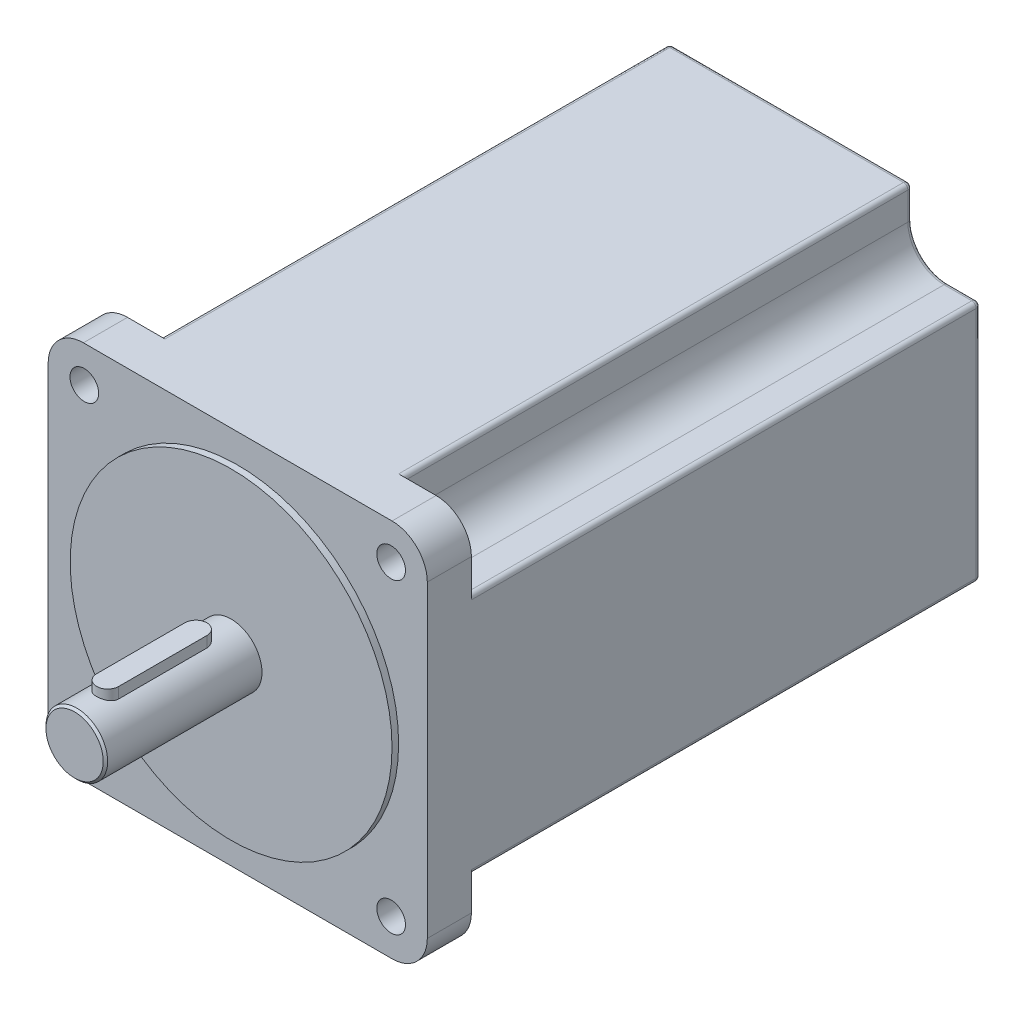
ISO-10303-21;
HEADER;
FILE_DESCRIPTION(('STEP AP214'),'2;1');
FILE_NAME('part.step','',(''),(''),'','','');
FILE_SCHEMA(('AUTOMOTIVE_DESIGN { 1 0 10303 214 1 1 1 1 }'));
ENDSEC;
DATA;
#1=APPLICATION_CONTEXT('core data for automotive mechanical design processes');
#2=APPLICATION_PROTOCOL_DEFINITION('international standard','automotive_design',2000,#1);
#3=PRODUCT_CONTEXT('',#1,'mechanical');
#4=PRODUCT('Part','Part','',(#3));
#5=PRODUCT_RELATED_PRODUCT_CATEGORY('part','',(#4));
#6=PRODUCT_DEFINITION_FORMATION('','',#4);
#7=PRODUCT_DEFINITION_CONTEXT('part definition',#1,'design');
#8=PRODUCT_DEFINITION('design','',#6,#7);
#9=PRODUCT_DEFINITION_SHAPE('','',#8);
#10=(LENGTH_UNIT() NAMED_UNIT(*) SI_UNIT(.MILLI.,.METRE.));
#11=(NAMED_UNIT(*) PLANE_ANGLE_UNIT() SI_UNIT($,.RADIAN.));
#12=(NAMED_UNIT(*) SI_UNIT($,.STERADIAN.) SOLID_ANGLE_UNIT());
#13=UNCERTAINTY_MEASURE_WITH_UNIT(LENGTH_MEASURE(1.E-05),#10,'distance_accuracy_value','');
#14=(GEOMETRIC_REPRESENTATION_CONTEXT(3) GLOBAL_UNCERTAINTY_ASSIGNED_CONTEXT((#13)) GLOBAL_UNIT_ASSIGNED_CONTEXT((#10,
#11,#12)) REPRESENTATION_CONTEXT('',''));
#15=CARTESIAN_POINT('',(0.,0.,0.));
#16=DIRECTION('',(0.,0.,1.));
#17=DIRECTION('',(1.,0.,0.));
#18=AXIS2_PLACEMENT_3D('',#15,#16,#17);
#19=CARTESIAN_POINT('',(0.,9.,28.));
#20=DIRECTION('',(0.,-1.,0.));
#21=DIRECTION('',(0.,0.,-1.));
#22=AXIS2_PLACEMENT_3D('',#19,#20,#21);
#23=CYLINDRICAL_SURFACE('',#22,2.5);
#24=CARTESIAN_POINT('',(0.,4.,28.));
#25=DIRECTION('',(0.,1.,0.));
#26=DIRECTION('',(0.,0.,1.));
#27=AXIS2_PLACEMENT_3D('',#24,#25,#26);
#28=CIRCLE('',#27,2.5);
#29=CARTESIAN_POINT('',(-2.5,4.,28.));
#30=VERTEX_POINT('',#29);
#31=CARTESIAN_POINT('',(2.5,4.,28.));
#32=VERTEX_POINT('',#31);
#33=EDGE_CURVE('E108',#30,#32,#28,.T.);
#34=ORIENTED_EDGE('',*,*,#33,.T.);
#35=DIRECTION('',(0.,-1.,0.));
#36=VECTOR('',#35,1.);
#37=CARTESIAN_POINT('',(2.5,9.,28.));
#38=LINE('',#37,#36);
#39=CARTESIAN_POINT('',(2.5,9.,28.));
#40=VERTEX_POINT('',#39);
#41=EDGE_CURVE('E12',#40,#32,#38,.T.);
#42=ORIENTED_EDGE('',*,*,#41,.F.);
#43=CARTESIAN_POINT('',(0.,9.,28.));
#44=DIRECTION('',(0.,1.,0.));
#45=DIRECTION('',(0.,0.,1.));
#46=AXIS2_PLACEMENT_3D('',#43,#44,#45);
#47=CIRCLE('',#46,2.5);
#48=CARTESIAN_POINT('',(-2.5,9.,28.));
#49=VERTEX_POINT('',#48);
#50=EDGE_CURVE('E96',#49,#40,#47,.T.);
#51=ORIENTED_EDGE('',*,*,#50,.F.);
#52=DIRECTION('',(0.,-1.,0.));
#53=VECTOR('',#52,1.);
#54=CARTESIAN_POINT('',(-2.5,9.,28.));
#55=LINE('',#54,#53);
#56=EDGE_CURVE('E104',#49,#30,#55,.T.);
#57=ORIENTED_EDGE('',*,*,#56,.T.);
#58=EDGE_LOOP('',(#34,#42,#51,#57));
#59=FACE_BOUND('',#58,.T.);
#60=ADVANCED_FACE('F45',(#59),#23,.T.);
#61=CARTESIAN_POINT('',(2.5,9.,28.));
#62=DIRECTION('',(-1.,0.,0.));
#63=DIRECTION('',(0.,0.,1.));
#64=AXIS2_PLACEMENT_3D('',#61,#62,#63);
#65=PLANE('',#64);
#66=DIRECTION('',(0.,0.,-1.));
#67=VECTOR('',#66,1.);
#68=CARTESIAN_POINT('',(2.5,4.,28.));
#69=LINE('',#68,#67);
#70=CARTESIAN_POINT('',(2.5,4.,8.));
#71=VERTEX_POINT('',#70);
#72=EDGE_CURVE('E100',#32,#71,#69,.T.);
#73=ORIENTED_EDGE('',*,*,#72,.T.);
#74=DIRECTION('',(0.,-1.,0.));
#75=VECTOR('',#74,1.);
#76=CARTESIAN_POINT('',(2.5,9.,8.));
#77=LINE('',#76,#75);
#78=CARTESIAN_POINT('',(2.5,9.,8.));
#79=VERTEX_POINT('',#78);
#80=EDGE_CURVE('E53',#79,#71,#77,.T.);
#81=ORIENTED_EDGE('',*,*,#80,.F.);
#82=DIRECTION('',(0.,0.,-1.));
#83=VECTOR('',#82,1.);
#84=CARTESIAN_POINT('',(2.5,9.,28.));
#85=LINE('',#84,#83);
#86=EDGE_CURVE('E91',#40,#79,#85,.T.);
#87=ORIENTED_EDGE('',*,*,#86,.F.);
#88=ORIENTED_EDGE('',*,*,#41,.T.);
#89=EDGE_LOOP('',(#73,#81,#87,#88));
#90=FACE_BOUND('',#89,.T.);
#91=ADVANCED_FACE('F99',(#90),#65,.F.);
#92=CARTESIAN_POINT('',(0.,9.,8.));
#93=DIRECTION('',(0.,-1.,0.));
#94=DIRECTION('',(0.,0.,-1.));
#95=AXIS2_PLACEMENT_3D('',#92,#93,#94);
#96=CYLINDRICAL_SURFACE('',#95,2.5);
#97=CARTESIAN_POINT('',(0.,4.,8.));
#98=DIRECTION('',(0.,1.,0.));
#99=DIRECTION('',(0.,0.,1.));
#100=AXIS2_PLACEMENT_3D('',#97,#98,#99);
#101=CIRCLE('',#100,2.5);
#102=CARTESIAN_POINT('',(-2.5,4.,8.));
#103=VERTEX_POINT('',#102);
#104=EDGE_CURVE('E78',#71,#103,#101,.T.);
#105=ORIENTED_EDGE('',*,*,#104,.T.);
#106=DIRECTION('',(0.,-1.,0.));
#107=VECTOR('',#106,1.);
#108=CARTESIAN_POINT('',(-2.5,9.,8.));
#109=LINE('',#108,#107);
#110=CARTESIAN_POINT('',(-2.5,9.,8.));
#111=VERTEX_POINT('',#110);
#112=EDGE_CURVE('E101',#111,#103,#109,.T.);
#113=ORIENTED_EDGE('',*,*,#112,.F.);
#114=CARTESIAN_POINT('',(0.,9.,8.));
#115=DIRECTION('',(0.,1.,0.));
#116=DIRECTION('',(0.,0.,1.));
#117=AXIS2_PLACEMENT_3D('',#114,#115,#116);
#118=CIRCLE('',#117,2.5);
#119=EDGE_CURVE('E94',#79,#111,#118,.T.);
#120=ORIENTED_EDGE('',*,*,#119,.F.);
#121=ORIENTED_EDGE('',*,*,#80,.T.);
#122=EDGE_LOOP('',(#105,#113,#120,#121));
#123=FACE_BOUND('',#122,.T.);
#124=ADVANCED_FACE('F102',(#123),#96,.T.);
#125=CARTESIAN_POINT('',(-2.5,9.,28.));
#126=DIRECTION('',(1.,0.,0.));
#127=DIRECTION('',(0.,0.,-1.));
#128=AXIS2_PLACEMENT_3D('',#125,#126,#127);
#129=PLANE('',#128);
#130=DIRECTION('',(0.,0.,1.));
#131=VECTOR('',#130,1.);
#132=CARTESIAN_POINT('',(-2.5,4.,28.));
#133=LINE('',#132,#131);
#134=EDGE_CURVE('E84',#103,#30,#133,.T.);
#135=ORIENTED_EDGE('',*,*,#134,.T.);
#136=ORIENTED_EDGE('',*,*,#56,.F.);
#137=DIRECTION('',(0.,0.,1.));
#138=VECTOR('',#137,1.);
#139=CARTESIAN_POINT('',(-2.5,9.,28.));
#140=LINE('',#139,#138);
#141=EDGE_CURVE('E61',#111,#49,#140,.T.);
#142=ORIENTED_EDGE('',*,*,#141,.F.);
#143=ORIENTED_EDGE('',*,*,#112,.T.);
#144=EDGE_LOOP('',(#135,#136,#142,#143));
#145=FACE_BOUND('',#144,.T.);
#146=ADVANCED_FACE('F115',(#145),#129,.F.);
#147=CARTESIAN_POINT('',(0.,9.,28.));
#148=DIRECTION('',(0.,1.,0.));
#149=DIRECTION('',(0.,0.,1.));
#150=AXIS2_PLACEMENT_3D('',#147,#148,#149);
#151=PLANE('',#150);
#152=ORIENTED_EDGE('',*,*,#50,.T.);
#153=ORIENTED_EDGE('',*,*,#86,.T.);
#154=ORIENTED_EDGE('',*,*,#119,.T.);
#155=ORIENTED_EDGE('',*,*,#141,.T.);
#156=EDGE_LOOP('',(#152,#153,#154,#155));
#157=FACE_BOUND('',#156,.T.);
#158=ADVANCED_FACE('F92',(#157),#151,.T.);
#159=CARTESIAN_POINT('',(0.,4.,28.));
#160=DIRECTION('',(0.,1.,0.));
#161=DIRECTION('',(0.,0.,1.));
#162=AXIS2_PLACEMENT_3D('',#159,#160,#161);
#163=PLANE('',#162);
#164=ORIENTED_EDGE('',*,*,#33,.F.);
#165=ORIENTED_EDGE('',*,*,#134,.F.);
#166=ORIENTED_EDGE('',*,*,#104,.F.);
#167=ORIENTED_EDGE('',*,*,#72,.F.);
#168=EDGE_LOOP('',(#164,#165,#166,#167));
#169=FACE_BOUND('',#168,.T.);
#170=ADVANCED_FACE('F118',(#169),#163,.F.);
#171=CLOSED_SHELL('',(#60,#91,#124,#146,#158,#170));
#172=MANIFOLD_SOLID_BREP('B2',#171);
#173=CARTESIAN_POINT('',(35.,-35.,-127.));
#174=DIRECTION('',(0.,0.,1.));
#175=DIRECTION('',(1.,0.,0.));
#176=AXIS2_PLACEMENT_3D('',#173,#174,#175);
#177=CYLINDRICAL_SURFACE('',#176,8.);
#178=CARTESIAN_POINT('',(35.,-35.,-11.5));
#179=DIRECTION('',(0.,0.,-1.));
#180=DIRECTION('',(-1.,0.,0.));
#181=AXIS2_PLACEMENT_3D('',#178,#179,#180);
#182=CIRCLE('',#181,8.);
#183=CARTESIAN_POINT('',(43.,-35.,-11.5));
#184=VERTEX_POINT('',#183);
#185=CARTESIAN_POINT('',(34.9999999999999,-43.,-11.5));
#186=VERTEX_POINT('',#185);
#187=EDGE_CURVE('E522',#184,#186,#182,.T.);
#188=ORIENTED_EDGE('',*,*,#187,.F.);
#189=DIRECTION('',(0.,0.,1.));
#190=VECTOR('',#189,1.);
#191=CARTESIAN_POINT('',(43.,-35.,-127.));
#192=LINE('',#191,#190);
#193=CARTESIAN_POINT('',(43.,-35.,-1.5));
#194=VERTEX_POINT('',#193);
#195=EDGE_CURVE('E684',#184,#194,#192,.T.);
#196=ORIENTED_EDGE('',*,*,#195,.T.);
#197=CARTESIAN_POINT('',(35.,-35.,-1.5));
#198=DIRECTION('',(0.,0.,-1.));
#199=DIRECTION('',(1.,0.,0.));
#200=AXIS2_PLACEMENT_3D('',#197,#198,#199);
#201=CIRCLE('',#200,8.);
#202=CARTESIAN_POINT('',(34.9999999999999,-43.,-1.5));
#203=VERTEX_POINT('',#202);
#204=EDGE_CURVE('E660',#194,#203,#201,.T.);
#205=ORIENTED_EDGE('',*,*,#204,.T.);
#206=DIRECTION('',(0.,0.,1.));
#207=VECTOR('',#206,1.);
#208=CARTESIAN_POINT('',(34.9999999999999,-43.,-127.));
#209=LINE('',#208,#207);
#210=EDGE_CURVE('E698',#186,#203,#209,.T.);
#211=ORIENTED_EDGE('',*,*,#210,.F.);
#212=EDGE_LOOP('',(#188,#196,#205,#211));
#213=FACE_BOUND('',#212,.T.);
#214=ADVANCED_FACE('F169',(#213),#177,.T.);
#215=CARTESIAN_POINT('',(34.8,-34.8,-127.));
#216=DIRECTION('',(0.,0.,1.));
#217=DIRECTION('',(1.,0.,0.));
#218=AXIS2_PLACEMENT_3D('',#215,#216,#217);
#219=CYLINDRICAL_SURFACE('',#218,3.25);
#220=CARTESIAN_POINT('',(34.8,-34.8,-1.5));
#221=DIRECTION('',(0.,0.,-1.));
#222=DIRECTION('',(-1.,0.,0.));
#223=AXIS2_PLACEMENT_3D('',#220,#221,#222);
#224=CIRCLE('',#223,3.25);
#225=CARTESIAN_POINT('',(31.55,-34.8,-1.5));
#226=VERTEX_POINT('',#225);
#227=EDGE_CURVE('E648',#226,#226,#224,.T.);
#228=ORIENTED_EDGE('',*,*,#227,.F.);
#229=EDGE_LOOP('',(#228));
#230=FACE_BOUND('',#229,.T.);
#231=CARTESIAN_POINT('',(34.8,-34.8,-11.5));
#232=DIRECTION('',(0.,0.,-1.));
#233=DIRECTION('',(-1.,0.,0.));
#234=AXIS2_PLACEMENT_3D('',#231,#232,#233);
#235=CIRCLE('',#234,3.25);
#236=CARTESIAN_POINT('',(31.55,-34.8,-11.5));
#237=VERTEX_POINT('',#236);
#238=EDGE_CURVE('E507',#237,#237,#235,.T.);
#239=ORIENTED_EDGE('',*,*,#238,.T.);
#240=EDGE_LOOP('',(#239));
#241=FACE_BOUND('',#240,.T.);
#242=ADVANCED_FACE('F842',(#230,#241),#219,.F.);
#243=CARTESIAN_POINT('',(-35.,-35.,-127.));
#244=DIRECTION('',(0.,0.,1.));
#245=DIRECTION('',(1.,0.,0.));
#246=AXIS2_PLACEMENT_3D('',#243,#244,#245);
#247=CYLINDRICAL_SURFACE('',#246,8.);
#248=CARTESIAN_POINT('',(-35.,-35.,-11.5));
#249=DIRECTION('',(0.,0.,-1.));
#250=DIRECTION('',(-1.,0.,0.));
#251=AXIS2_PLACEMENT_3D('',#248,#249,#250);
#252=CIRCLE('',#251,8.);
#253=CARTESIAN_POINT('',(-35.,-43.,-11.5));
#254=VERTEX_POINT('',#253);
#255=CARTESIAN_POINT('',(-43.,-34.9999999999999,-11.5));
#256=VERTEX_POINT('',#255);
#257=EDGE_CURVE('E561',#254,#256,#252,.T.);
#258=ORIENTED_EDGE('',*,*,#257,.F.);
#259=DIRECTION('',(0.,0.,1.));
#260=VECTOR('',#259,1.);
#261=CARTESIAN_POINT('',(-35.,-43.,-127.));
#262=LINE('',#261,#260);
#263=CARTESIAN_POINT('',(-35.,-43.,-1.5));
#264=VERTEX_POINT('',#263);
#265=EDGE_CURVE('E696',#254,#264,#262,.T.);
#266=ORIENTED_EDGE('',*,*,#265,.T.);
#267=CARTESIAN_POINT('',(-35.,-35.,-1.5));
#268=DIRECTION('',(0.,0.,-1.));
#269=DIRECTION('',(1.,0.,0.));
#270=AXIS2_PLACEMENT_3D('',#267,#268,#269);
#271=CIRCLE('',#270,8.);
#272=CARTESIAN_POINT('',(-43.,-34.9999999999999,-1.5));
#273=VERTEX_POINT('',#272);
#274=EDGE_CURVE('E666',#264,#273,#271,.T.);
#275=ORIENTED_EDGE('',*,*,#274,.T.);
#276=DIRECTION('',(0.,0.,1.));
#277=VECTOR('',#276,1.);
#278=CARTESIAN_POINT('',(-43.,-34.9999999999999,-127.));
#279=LINE('',#278,#277);
#280=EDGE_CURVE('E694',#256,#273,#279,.T.);
#281=ORIENTED_EDGE('',*,*,#280,.F.);
#282=EDGE_LOOP('',(#258,#266,#275,#281));
#283=FACE_BOUND('',#282,.T.);
#284=ADVANCED_FACE('F845',(#283),#247,.T.);
#285=CARTESIAN_POINT('',(-34.8,-34.8,-127.));
#286=DIRECTION('',(0.,0.,1.));
#287=DIRECTION('',(1.,0.,0.));
#288=AXIS2_PLACEMENT_3D('',#285,#286,#287);
#289=CYLINDRICAL_SURFACE('',#288,3.25);
#290=CARTESIAN_POINT('',(-34.8,-34.8,-1.5));
#291=DIRECTION('',(0.,0.,-1.));
#292=DIRECTION('',(-1.,0.,0.));
#293=AXIS2_PLACEMENT_3D('',#290,#291,#292);
#294=CIRCLE('',#293,3.25);
#295=CARTESIAN_POINT('',(-38.05,-34.8,-1.5));
#296=VERTEX_POINT('',#295);
#297=EDGE_CURVE('E651',#296,#296,#294,.T.);
#298=ORIENTED_EDGE('',*,*,#297,.F.);
#299=EDGE_LOOP('',(#298));
#300=FACE_BOUND('',#299,.T.);
#301=CARTESIAN_POINT('',(-34.8,-34.8,-11.5));
#302=DIRECTION('',(0.,0.,-1.));
#303=DIRECTION('',(-1.,0.,0.));
#304=AXIS2_PLACEMENT_3D('',#301,#302,#303);
#305=CIRCLE('',#304,3.25);
#306=CARTESIAN_POINT('',(-38.05,-34.8,-11.5));
#307=VERTEX_POINT('',#306);
#308=EDGE_CURVE('E545',#307,#307,#305,.T.);
#309=ORIENTED_EDGE('',*,*,#308,.T.);
#310=EDGE_LOOP('',(#309));
#311=FACE_BOUND('',#310,.T.);
#312=ADVANCED_FACE('F847',(#300,#311),#289,.F.);
#313=CARTESIAN_POINT('',(35.,35.,-127.));
#314=DIRECTION('',(0.,0.,1.));
#315=DIRECTION('',(1.,0.,0.));
#316=AXIS2_PLACEMENT_3D('',#313,#314,#315);
#317=CYLINDRICAL_SURFACE('',#316,8.);
#318=CARTESIAN_POINT('',(35.,35.,-11.5));
#319=DIRECTION('',(0.,0.,-1.));
#320=DIRECTION('',(-1.,0.,0.));
#321=AXIS2_PLACEMENT_3D('',#318,#319,#320);
#322=CIRCLE('',#321,8.);
#323=CARTESIAN_POINT('',(34.9999999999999,43.,-11.5));
#324=VERTEX_POINT('',#323);
#325=CARTESIAN_POINT('',(43.,34.9999999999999,-11.5));
#326=VERTEX_POINT('',#325);
#327=EDGE_CURVE('E601',#324,#326,#322,.T.);
#328=ORIENTED_EDGE('',*,*,#327,.F.);
#329=DIRECTION('',(0.,0.,1.));
#330=VECTOR('',#329,1.);
#331=CARTESIAN_POINT('',(34.9999999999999,43.,-127.));
#332=LINE('',#331,#330);
#333=CARTESIAN_POINT('',(34.9999999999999,43.,-1.5));
#334=VERTEX_POINT('',#333);
#335=EDGE_CURVE('E688',#324,#334,#332,.T.);
#336=ORIENTED_EDGE('',*,*,#335,.T.);
#337=CARTESIAN_POINT('',(35.,35.,-1.5));
#338=DIRECTION('',(0.,0.,-1.));
#339=DIRECTION('',(1.,0.,0.));
#340=AXIS2_PLACEMENT_3D('',#337,#338,#339);
#341=CIRCLE('',#340,8.);
#342=CARTESIAN_POINT('',(43.,34.9999999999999,-1.5));
#343=VERTEX_POINT('',#342);
#344=EDGE_CURVE('E678',#334,#343,#341,.T.);
#345=ORIENTED_EDGE('',*,*,#344,.T.);
#346=DIRECTION('',(0.,0.,1.));
#347=VECTOR('',#346,1.);
#348=CARTESIAN_POINT('',(43.,34.9999999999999,-127.));
#349=LINE('',#348,#347);
#350=EDGE_CURVE('E686',#326,#343,#349,.T.);
#351=ORIENTED_EDGE('',*,*,#350,.F.);
#352=EDGE_LOOP('',(#328,#336,#345,#351));
#353=FACE_BOUND('',#352,.T.);
#354=ADVANCED_FACE('F850',(#353),#317,.T.);
#355=CARTESIAN_POINT('',(34.8,34.8,-127.));
#356=DIRECTION('',(0.,0.,1.));
#357=DIRECTION('',(1.,0.,0.));
#358=AXIS2_PLACEMENT_3D('',#355,#356,#357);
#359=CYLINDRICAL_SURFACE('',#358,3.25);
#360=CARTESIAN_POINT('',(34.8,34.8,-1.5));
#361=DIRECTION('',(0.,0.,-1.));
#362=DIRECTION('',(-1.,0.,0.));
#363=AXIS2_PLACEMENT_3D('',#360,#361,#362);
#364=CIRCLE('',#363,3.25);
#365=CARTESIAN_POINT('',(31.55,34.8,-1.5));
#366=VERTEX_POINT('',#365);
#367=EDGE_CURVE('E657',#366,#366,#364,.T.);
#368=ORIENTED_EDGE('',*,*,#367,.F.);
#369=EDGE_LOOP('',(#368));
#370=FACE_BOUND('',#369,.T.);
#371=CARTESIAN_POINT('',(34.8,34.8,-11.5));
#372=DIRECTION('',(0.,0.,-1.));
#373=DIRECTION('',(-1.,0.,0.));
#374=AXIS2_PLACEMENT_3D('',#371,#372,#373);
#375=CIRCLE('',#374,3.25);
#376=CARTESIAN_POINT('',(31.55,34.8,-11.5));
#377=VERTEX_POINT('',#376);
#378=EDGE_CURVE('E584',#377,#377,#375,.T.);
#379=ORIENTED_EDGE('',*,*,#378,.T.);
#380=EDGE_LOOP('',(#379));
#381=FACE_BOUND('',#380,.T.);
#382=ADVANCED_FACE('F856',(#370,#381),#359,.F.);
#383=CARTESIAN_POINT('',(0.,0.,0.));
#384=DIRECTION('',(0.,0.,1.));
#385=DIRECTION('',(1.,0.,0.));
#386=AXIS2_PLACEMENT_3D('',#383,#384,#385);
#387=PLANE('',#386);
#388=CARTESIAN_POINT('',(0.,0.,0.));
#389=DIRECTION('',(0.,0.,1.));
#390=DIRECTION('',(1.,0.,0.));
#391=AXIS2_PLACEMENT_3D('',#388,#389,#390);
#392=CIRCLE('',#391,36.5);
#393=CARTESIAN_POINT('',(36.5,0.,0.));
#394=VERTEX_POINT('',#393);
#395=EDGE_CURVE('E706',#394,#394,#392,.T.);
#396=ORIENTED_EDGE('',*,*,#395,.T.);
#397=EDGE_LOOP('',(#396));
#398=FACE_BOUND('',#397,.T.);
#399=CARTESIAN_POINT('',(0.,0.,0.));
#400=DIRECTION('',(0.,0.,1.));
#401=DIRECTION('',(1.,0.,0.));
#402=AXIS2_PLACEMENT_3D('',#399,#400,#401);
#403=CIRCLE('',#402,7.);
#404=CARTESIAN_POINT('',(7.,0.,0.));
#405=VERTEX_POINT('',#404);
#406=EDGE_CURVE('E703',#405,#405,#403,.T.);
#407=ORIENTED_EDGE('',*,*,#406,.F.);
#408=EDGE_LOOP('',(#407));
#409=FACE_BOUND('',#408,.T.);
#410=ADVANCED_FACE('F859',(#398,#409),#387,.T.);
#411=CARTESIAN_POINT('',(0.,0.,-1.5));
#412=DIRECTION('',(0.,0.,1.));
#413=DIRECTION('',(1.,0.,0.));
#414=AXIS2_PLACEMENT_3D('',#411,#412,#413);
#415=CYLINDRICAL_SURFACE('',#414,36.5);
#416=CARTESIAN_POINT('',(0.,0.,-1.5));
#417=DIRECTION('',(0.,0.,1.));
#418=DIRECTION('',(1.,0.,0.));
#419=AXIS2_PLACEMENT_3D('',#416,#417,#418);
#420=CIRCLE('',#419,36.5);
#421=CARTESIAN_POINT('',(36.5,0.,-1.5));
#422=VERTEX_POINT('',#421);
#423=EDGE_CURVE('E700',#422,#422,#420,.F.);
#424=ORIENTED_EDGE('',*,*,#423,.F.);
#425=EDGE_LOOP('',(#424));
#426=FACE_BOUND('',#425,.T.);
#427=ORIENTED_EDGE('',*,*,#395,.F.);
#428=EDGE_LOOP('',(#427));
#429=FACE_BOUND('',#428,.T.);
#430=ADVANCED_FACE('F901',(#426,#429),#415,.T.);
#431=CARTESIAN_POINT('',(0.,0.,35.5));
#432=DIRECTION('',(0.,0.,-1.));
#433=DIRECTION('',(-1.,0.,0.));
#434=AXIS2_PLACEMENT_3D('',#431,#432,#433);
#435=CYLINDRICAL_SURFACE('',#434,7.);
#436=CARTESIAN_POINT('',(0.,0.,35.));
#437=DIRECTION('',(0.,0.,1.));
#438=DIRECTION('',(1.,0.,0.));
#439=AXIS2_PLACEMENT_3D('',#436,#437,#438);
#440=CIRCLE('',#439,7.);
#441=CARTESIAN_POINT('',(7.,0.,35.));
#442=VERTEX_POINT('',#441);
#443=EDGE_CURVE('E907',#442,#442,#440,.F.);
#444=ORIENTED_EDGE('',*,*,#443,.T.);
#445=EDGE_LOOP('',(#444));
#446=FACE_BOUND('',#445,.T.);
#447=DIRECTION('',(0.,0.,-1.));
#448=VECTOR('',#447,1.);
#449=CARTESIAN_POINT('',(2.5,6.53834841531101,35.5));
#450=LINE('',#449,#448);
#451=CARTESIAN_POINT('',(2.5,6.53834841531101,8.));
#452=VERTEX_POINT('',#451);
#453=CARTESIAN_POINT('',(2.5,6.53834841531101,28.));
#454=VERTEX_POINT('',#453);
#455=EDGE_CURVE('E908',#452,#454,#450,.F.);
#456=ORIENTED_EDGE('',*,*,#455,.T.);
#457=CARTESIAN_POINT('',(2.5,6.53834841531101,28.));
#458=CARTESIAN_POINT('',(2.50000932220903,6.53833653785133,28.0678892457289));
#459=CARTESIAN_POINT('',(2.49723485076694,6.53940549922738,28.1357719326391));
#460=CARTESIAN_POINT('',(2.4861910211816,6.54361657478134,28.2710039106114));
#461=CARTESIAN_POINT('',(2.47792334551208,6.54675805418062,28.3383533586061));
#462=CARTESIAN_POINT('',(2.456001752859,6.55501217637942,28.4718214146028));
#463=CARTESIAN_POINT('',(2.44236559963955,6.56011831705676,28.5379433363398));
#464=CARTESIAN_POINT('',(2.40985115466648,6.57213177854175,28.6687018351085));
#465=CARTESIAN_POINT('',(2.39097263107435,6.57903917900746,28.7333383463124));
#466=CARTESIAN_POINT('',(2.32673964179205,6.60214934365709,28.9242643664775));
#467=CARTESIAN_POINT('',(2.27375112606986,6.62075475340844,29.0477904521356));
#468=CARTESIAN_POINT('',(2.14910757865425,6.6622539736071,29.284230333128));
#469=CARTESIAN_POINT('',(2.07743895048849,6.68515090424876,29.3971363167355));
#470=CARTESIAN_POINT('',(1.9140257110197,6.73379913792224,29.6142152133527));
#471=CARTESIAN_POINT('',(1.82158337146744,6.75962864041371,29.7178464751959));
#472=CARTESIAN_POINT('',(1.6207338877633,6.81057592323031,29.9085087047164));
#473=CARTESIAN_POINT('',(1.51232377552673,6.83569357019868,29.9955365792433));
#474=CARTESIAN_POINT('',(1.27853915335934,6.88331133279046,30.153089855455));
#475=CARTESIAN_POINT('',(1.15274833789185,6.90570835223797,30.2230315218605));
#476=CARTESIAN_POINT('',(0.890250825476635,6.94442357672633,30.3405366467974));
#477=CARTESIAN_POINT('',(0.753547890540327,6.96074386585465,30.388107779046));
#478=CARTESIAN_POINT('',(0.478829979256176,6.9849105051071,30.4576406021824));
#479=CARTESIAN_POINT('',(0.341079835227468,6.99306594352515,30.4805391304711));
#480=CARTESIAN_POINT('',(0.0634643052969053,7.00108798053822,30.5030684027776));
#481=CARTESIAN_POINT('',(-0.0764004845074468,7.00095687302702,30.5027055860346));
#482=CARTESIAN_POINT('',(-0.347593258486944,6.99262258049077,30.4792887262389));
#483=CARTESIAN_POINT('',(-0.479022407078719,6.98478243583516,30.4572552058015));
#484=CARTESIAN_POINT('',(-0.736175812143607,6.96237832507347,30.3928265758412));
#485=CARTESIAN_POINT('',(-0.861899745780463,6.94781397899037,30.3504303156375));
#486=CARTESIAN_POINT('',(-1.10616102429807,6.91316506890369,30.2459530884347));
#487=CARTESIAN_POINT('',(-1.22457279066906,6.89300592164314,30.1836042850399));
#488=CARTESIAN_POINT('',(-1.44953531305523,6.8492335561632,30.0412206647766));
#489=CARTESIAN_POINT('',(-1.5560824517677,6.82561928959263,29.9611804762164));
#490=CARTESIAN_POINT('',(-1.7603244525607,6.7759054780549,29.7806767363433));
#491=CARTESIAN_POINT('',(-1.85724185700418,6.74974055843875,29.6793502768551));
#492=CARTESIAN_POINT('',(-2.03299914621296,6.69890342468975,29.4616726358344));
#493=CARTESIAN_POINT('',(-2.11183255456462,6.67423174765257,29.3453160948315));
#494=CARTESIAN_POINT('',(-2.25049860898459,6.62877803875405,29.098057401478));
#495=CARTESIAN_POINT('',(-2.30994207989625,6.60807875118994,28.9669210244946));
#496=CARTESIAN_POINT('',(-2.4055543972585,6.57388213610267,28.6956351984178));
#497=CARTESIAN_POINT('',(-2.44176119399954,6.56037307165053,28.555500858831));
#498=CARTESIAN_POINT('',(-2.47705497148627,6.54708542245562,28.3449694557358));
#499=CARTESIAN_POINT('',(-2.48565347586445,6.54382010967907,28.2762636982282));
#500=CARTESIAN_POINT('',(-2.49712352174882,6.53944910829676,28.1383848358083));
#501=CARTESIAN_POINT('',(-2.50000139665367,6.53834103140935,28.0692123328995));
#502=CARTESIAN_POINT('',(-2.5,6.53834841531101,28.));
#503=B_SPLINE_CURVE_WITH_KNOTS('',3,(#457,#458,#459,#460,#461,#462,#463,#464,#465,#466,#467,
#468,#469,#470,#471,#472,#473,#474,#475,#476,#477,#478,#479,#480,#481,#482,#483,#484,#485,#486,
#487,#488,#489,#490,#491,#492,#493,#494,#495,#496,#497,#498,#499,#500,#501,#502),.UNSPECIFIED.,
.F.,.F.,(4,2,2,2,2,2,2,2,2,2,2,2,2,2,2,2,2,2,2,2,2,2,4),(0.,0.203591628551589,0.407120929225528,
0.609982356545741,0.812852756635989,1.21793118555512,1.6233052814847,2.0451597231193,
2.4670926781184,2.90188398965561,3.33652604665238,3.75400993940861,4.17137826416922,
4.56998920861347,4.96862268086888,5.37284909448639,5.77719841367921,6.20315837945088,
6.6292706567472,7.06347329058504,7.49696496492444,7.70468580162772,7.91217653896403),.UNSPECIFIED.);
#504=CARTESIAN_POINT('',(-2.5,6.53834841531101,28.));
#505=VERTEX_POINT('',#504);
#506=EDGE_CURVE('E709',#454,#505,#503,.T.);
#507=ORIENTED_EDGE('',*,*,#506,.T.);
#508=DIRECTION('',(0.,0.,-1.));
#509=VECTOR('',#508,1.);
#510=CARTESIAN_POINT('',(-2.5,6.53834841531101,35.5));
#511=LINE('',#510,#509);
#512=CARTESIAN_POINT('',(-2.5,6.53834841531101,8.));
#513=VERTEX_POINT('',#512);
#514=EDGE_CURVE('E914',#505,#513,#511,.T.);
#515=ORIENTED_EDGE('',*,*,#514,.T.);
#516=CARTESIAN_POINT('',(-2.5,6.53834841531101,8.));
#517=CARTESIAN_POINT('',(-2.50000932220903,6.53833653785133,7.93211075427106));
#518=CARTESIAN_POINT('',(-2.49723485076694,6.53940549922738,7.86422806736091));
#519=CARTESIAN_POINT('',(-2.4861910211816,6.54361657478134,7.72899608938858));
#520=CARTESIAN_POINT('',(-2.47792334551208,6.54675805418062,7.66164664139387));
#521=CARTESIAN_POINT('',(-2.456001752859,6.55501217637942,7.52817858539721));
#522=CARTESIAN_POINT('',(-2.44236559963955,6.56011831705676,7.46205666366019));
#523=CARTESIAN_POINT('',(-2.40985115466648,6.57213177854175,7.33129816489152));
#524=CARTESIAN_POINT('',(-2.39097263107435,6.57903917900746,7.26666165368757));
#525=CARTESIAN_POINT('',(-2.32673964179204,6.6021493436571,7.07573563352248));
#526=CARTESIAN_POINT('',(-2.27375112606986,6.62075475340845,6.95220954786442));
#527=CARTESIAN_POINT('',(-2.14910757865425,6.6622539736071,6.71576966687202));
#528=CARTESIAN_POINT('',(-2.07743895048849,6.68515090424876,6.60286368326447));
#529=CARTESIAN_POINT('',(-1.9140257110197,6.73379913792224,6.38578478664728));
#530=CARTESIAN_POINT('',(-1.82158337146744,6.75962864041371,6.28215352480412));
#531=CARTESIAN_POINT('',(-1.6207338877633,6.81057592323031,6.09149129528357));
#532=CARTESIAN_POINT('',(-1.51232377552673,6.83569357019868,6.00446342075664));
#533=CARTESIAN_POINT('',(-1.27853915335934,6.88331133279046,5.84691014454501));
#534=CARTESIAN_POINT('',(-1.15274833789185,6.90570835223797,5.77696847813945));
#535=CARTESIAN_POINT('',(-0.890250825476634,6.94442357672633,5.65946335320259));
#536=CARTESIAN_POINT('',(-0.753547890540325,6.96074386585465,5.61189222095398));
#537=CARTESIAN_POINT('',(-0.478829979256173,6.9849105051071,5.54235939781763));
#538=CARTESIAN_POINT('',(-0.341079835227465,6.99306594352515,5.51946086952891));
#539=CARTESIAN_POINT('',(-0.0634643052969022,7.00108798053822,5.49693159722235));
#540=CARTESIAN_POINT('',(0.0764004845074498,7.00095687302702,5.49729441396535));
#541=CARTESIAN_POINT('',(0.347593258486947,6.99262258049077,5.52071127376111));
#542=CARTESIAN_POINT('',(0.479022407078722,6.98478243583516,5.54274479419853));
#543=CARTESIAN_POINT('',(0.736175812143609,6.96237832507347,5.6071734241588));
#544=CARTESIAN_POINT('',(0.861899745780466,6.94781397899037,5.64956968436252));
#545=CARTESIAN_POINT('',(1.10616102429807,6.91316506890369,5.75404691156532));
#546=CARTESIAN_POINT('',(1.22457279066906,6.89300592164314,5.81639571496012));
#547=CARTESIAN_POINT('',(1.44953531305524,6.8492335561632,5.95877933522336));
#548=CARTESIAN_POINT('',(1.55608245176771,6.82561928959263,6.03881952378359));
#549=CARTESIAN_POINT('',(1.7603244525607,6.7759054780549,6.2193232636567));
#550=CARTESIAN_POINT('',(1.85724185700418,6.74974055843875,6.32064972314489));
#551=CARTESIAN_POINT('',(2.03299914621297,6.69890342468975,6.53832736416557));
#552=CARTESIAN_POINT('',(2.11183255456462,6.67423174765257,6.65468390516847));
#553=CARTESIAN_POINT('',(2.25049860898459,6.62877803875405,6.90194259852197));
#554=CARTESIAN_POINT('',(2.30994207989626,6.60807875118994,7.03307897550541));
#555=CARTESIAN_POINT('',(2.4055543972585,6.57388213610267,7.30436480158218));
#556=CARTESIAN_POINT('',(2.44176119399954,6.56037307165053,7.44449914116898));
#557=CARTESIAN_POINT('',(2.47705497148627,6.54708542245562,7.65503054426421));
#558=CARTESIAN_POINT('',(2.48565347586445,6.54382010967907,7.72373630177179));
#559=CARTESIAN_POINT('',(2.49712352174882,6.53944910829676,7.86161516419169));
#560=CARTESIAN_POINT('',(2.50000139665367,6.53834103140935,7.93078766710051));
#561=CARTESIAN_POINT('',(2.5,6.53834841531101,7.99999999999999));
#562=B_SPLINE_CURVE_WITH_KNOTS('',3,(#516,#517,#518,#519,#520,#521,#522,#523,#524,#525,#526,
#527,#528,#529,#530,#531,#532,#533,#534,#535,#536,#537,#538,#539,#540,#541,#542,#543,#544,#545,
#546,#547,#548,#549,#550,#551,#552,#553,#554,#555,#556,#557,#558,#559,#560,#561),.UNSPECIFIED.,
.F.,.F.,(4,2,2,2,2,2,2,2,2,2,2,2,2,2,2,2,2,2,2,2,2,2,4),(0.,0.20359162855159,0.40712092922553,
0.609982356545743,0.81285275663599,1.21793118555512,1.6233052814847,2.0451597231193,
2.4670926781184,2.90188398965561,3.33652604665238,3.75400993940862,4.17137826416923,
4.56998920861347,4.96862268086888,5.3728490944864,5.77719841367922,6.20315837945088,
6.62927065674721,7.06347329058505,7.49696496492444,7.70468580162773,7.91217653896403),.UNSPECIFIED.);
#563=EDGE_CURVE('E460',#513,#452,#562,.T.);
#564=ORIENTED_EDGE('',*,*,#563,.T.);
#565=EDGE_LOOP('',(#456,#507,#515,#564));
#566=FACE_BOUND('',#565,.T.);
#567=ORIENTED_EDGE('',*,*,#406,.T.);
#568=EDGE_LOOP('',(#567));
#569=FACE_BOUND('',#568,.T.);
#570=ADVANCED_FACE('F730',(#446,#566,#569),#435,.T.);
#571=CARTESIAN_POINT('',(0.,0.,35.5));
#572=DIRECTION('',(0.,0.,1.));
#573=DIRECTION('',(1.,0.,0.));
#574=AXIS2_PLACEMENT_3D('',#571,#572,#573);
#575=PLANE('',#574);
#576=CARTESIAN_POINT('',(0.,0.,35.5));
#577=DIRECTION('',(0.,0.,1.));
#578=DIRECTION('',(1.,0.,0.));
#579=AXIS2_PLACEMENT_3D('',#576,#577,#578);
#580=CIRCLE('',#579,6.50000000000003);
#581=CARTESIAN_POINT('',(6.50000000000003,0.,35.5));
#582=VERTEX_POINT('',#581);
#583=EDGE_CURVE('E905',#582,#582,#580,.T.);
#584=ORIENTED_EDGE('',*,*,#583,.T.);
#585=EDGE_LOOP('',(#584));
#586=FACE_BOUND('',#585,.T.);
#587=ADVANCED_FACE('F865',(#586),#575,.T.);
#588=CARTESIAN_POINT('',(35.,-35.,-127.));
#589=DIRECTION('',(0.,0.,1.));
#590=DIRECTION('',(1.,0.,0.));
#591=AXIS2_PLACEMENT_3D('',#588,#589,#590);
#592=PLANE('',#591);
#593=DIRECTION('',(1.,0.,0.));
#594=VECTOR('',#593,1.);
#595=CARTESIAN_POINT('',(35.,-26.5,-127.));
#596=LINE('',#595,#594);
#597=CARTESIAN_POINT('',(42.,-26.5,-127.));
#598=VERTEX_POINT('',#597);
#599=CARTESIAN_POINT('',(35.7,-26.5,-127.));
#600=VERTEX_POINT('',#599);
#601=EDGE_CURVE('E947',#598,#600,#596,.F.);
#602=ORIENTED_EDGE('',*,*,#601,.T.);
#603=CARTESIAN_POINT('',(35.7,-35.7,-127.));
#604=DIRECTION('',(0.,0.,1.));
#605=DIRECTION('',(1.,0.,0.));
#606=AXIS2_PLACEMENT_3D('',#603,#604,#605);
#607=CIRCLE('',#606,9.19999999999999);
#608=CARTESIAN_POINT('',(26.5,-35.7000000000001,-127.));
#609=VERTEX_POINT('',#608);
#610=EDGE_CURVE('E949',#600,#609,#607,.T.);
#611=ORIENTED_EDGE('',*,*,#610,.T.);
#612=DIRECTION('',(0.,1.,0.));
#613=VECTOR('',#612,1.);
#614=CARTESIAN_POINT('',(26.5,-35.,-127.));
#615=LINE('',#614,#613);
#616=CARTESIAN_POINT('',(26.5,-42.,-127.));
#617=VERTEX_POINT('',#616);
#618=EDGE_CURVE('E919',#609,#617,#615,.F.);
#619=ORIENTED_EDGE('',*,*,#618,.T.);
#620=DIRECTION('',(-1.,0.,0.));
#621=VECTOR('',#620,1.);
#622=CARTESIAN_POINT('',(35.,-42.,-127.));
#623=LINE('',#622,#621);
#624=CARTESIAN_POINT('',(-26.5,-42.,-127.));
#625=VERTEX_POINT('',#624);
#626=EDGE_CURVE('E921',#617,#625,#623,.T.);
#627=ORIENTED_EDGE('',*,*,#626,.T.);
#628=DIRECTION('',(0.,-1.,0.));
#629=VECTOR('',#628,1.);
#630=CARTESIAN_POINT('',(-26.5,-35.,-127.));
#631=LINE('',#630,#629);
#632=CARTESIAN_POINT('',(-26.5,-35.7000000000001,-127.));
#633=VERTEX_POINT('',#632);
#634=EDGE_CURVE('E923',#625,#633,#631,.F.);
#635=ORIENTED_EDGE('',*,*,#634,.T.);
#636=CARTESIAN_POINT('',(-35.7,-35.7,-127.));
#637=DIRECTION('',(0.,0.,1.));
#638=DIRECTION('',(1.,0.,0.));
#639=AXIS2_PLACEMENT_3D('',#636,#637,#638);
#640=CIRCLE('',#639,9.19999999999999);
#641=CARTESIAN_POINT('',(-35.7,-26.5,-127.));
#642=VERTEX_POINT('',#641);
#643=EDGE_CURVE('E925',#633,#642,#640,.T.);
#644=ORIENTED_EDGE('',*,*,#643,.T.);
#645=DIRECTION('',(1.,0.,0.));
#646=VECTOR('',#645,1.);
#647=CARTESIAN_POINT('',(35.,-26.5,-127.));
#648=LINE('',#647,#646);
#649=CARTESIAN_POINT('',(-42.,-26.5,-127.));
#650=VERTEX_POINT('',#649);
#651=EDGE_CURVE('E927',#642,#650,#648,.F.);
#652=ORIENTED_EDGE('',*,*,#651,.T.);
#653=DIRECTION('',(0.,1.,0.));
#654=VECTOR('',#653,1.);
#655=CARTESIAN_POINT('',(-42.,-35.,-127.));
#656=LINE('',#655,#654);
#657=CARTESIAN_POINT('',(-42.,26.5,-127.));
#658=VERTEX_POINT('',#657);
#659=EDGE_CURVE('E929',#650,#658,#656,.T.);
#660=ORIENTED_EDGE('',*,*,#659,.T.);
#661=DIRECTION('',(-1.,0.,0.));
#662=VECTOR('',#661,1.);
#663=CARTESIAN_POINT('',(35.,26.5,-127.));
#664=LINE('',#663,#662);
#665=CARTESIAN_POINT('',(-35.7000000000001,26.5,-127.));
#666=VERTEX_POINT('',#665);
#667=EDGE_CURVE('E931',#658,#666,#664,.F.);
#668=ORIENTED_EDGE('',*,*,#667,.T.);
#669=CARTESIAN_POINT('',(-35.7,35.7,-127.));
#670=DIRECTION('',(0.,0.,1.));
#671=DIRECTION('',(1.,0.,0.));
#672=AXIS2_PLACEMENT_3D('',#669,#670,#671);
#673=CIRCLE('',#672,9.2);
#674=CARTESIAN_POINT('',(-26.5,35.7000000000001,-127.));
#675=VERTEX_POINT('',#674);
#676=EDGE_CURVE('E933',#666,#675,#673,.T.);
#677=ORIENTED_EDGE('',*,*,#676,.T.);
#678=DIRECTION('',(0.,-1.,0.));
#679=VECTOR('',#678,1.);
#680=CARTESIAN_POINT('',(-26.5,-35.,-127.));
#681=LINE('',#680,#679);
#682=CARTESIAN_POINT('',(-26.5,42.,-127.));
#683=VERTEX_POINT('',#682);
#684=EDGE_CURVE('E935',#675,#683,#681,.F.);
#685=ORIENTED_EDGE('',*,*,#684,.T.);
#686=DIRECTION('',(1.,0.,0.));
#687=VECTOR('',#686,1.);
#688=CARTESIAN_POINT('',(35.,42.,-127.));
#689=LINE('',#688,#687);
#690=CARTESIAN_POINT('',(26.5,42.,-127.));
#691=VERTEX_POINT('',#690);
#692=EDGE_CURVE('E937',#683,#691,#689,.T.);
#693=ORIENTED_EDGE('',*,*,#692,.T.);
#694=DIRECTION('',(0.,1.,0.));
#695=VECTOR('',#694,1.);
#696=CARTESIAN_POINT('',(26.5,-35.,-127.));
#697=LINE('',#696,#695);
#698=CARTESIAN_POINT('',(26.5,35.7000000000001,-127.));
#699=VERTEX_POINT('',#698);
#700=EDGE_CURVE('E939',#691,#699,#697,.F.);
#701=ORIENTED_EDGE('',*,*,#700,.T.);
#702=CARTESIAN_POINT('',(35.7,35.7,-127.));
#703=DIRECTION('',(0.,0.,1.));
#704=DIRECTION('',(1.,0.,0.));
#705=AXIS2_PLACEMENT_3D('',#702,#703,#704);
#706=CIRCLE('',#705,9.2);
#707=CARTESIAN_POINT('',(35.7,26.5,-127.));
#708=VERTEX_POINT('',#707);
#709=EDGE_CURVE('E941',#699,#708,#706,.T.);
#710=ORIENTED_EDGE('',*,*,#709,.T.);
#711=DIRECTION('',(-1.,0.,0.));
#712=VECTOR('',#711,1.);
#713=CARTESIAN_POINT('',(35.,26.5,-127.));
#714=LINE('',#713,#712);
#715=CARTESIAN_POINT('',(42.,26.5,-127.));
#716=VERTEX_POINT('',#715);
#717=EDGE_CURVE('E943',#708,#716,#714,.F.);
#718=ORIENTED_EDGE('',*,*,#717,.T.);
#719=DIRECTION('',(0.,-1.,0.));
#720=VECTOR('',#719,1.);
#721=CARTESIAN_POINT('',(42.,-35.,-127.));
#722=LINE('',#721,#720);
#723=EDGE_CURVE('E945',#716,#598,#722,.T.);
#724=ORIENTED_EDGE('',*,*,#723,.T.);
#725=EDGE_LOOP('',(#602,#611,#619,#627,#635,#644,#652,#660,#668,#677,#685,#693,#701,#710,#718,#724));
#726=FACE_BOUND('',#725,.T.);
#727=ADVANCED_FACE('F861',(#726),#592,.F.);
#728=CARTESIAN_POINT('',(35.,-35.,-1.5));
#729=DIRECTION('',(0.,0.,1.));
#730=DIRECTION('',(1.,0.,0.));
#731=AXIS2_PLACEMENT_3D('',#728,#729,#730);
#732=PLANE('',#731);
#733=ORIENTED_EDGE('',*,*,#423,.T.);
#734=EDGE_LOOP('',(#733));
#735=FACE_BOUND('',#734,.T.);
#736=ORIENTED_EDGE('',*,*,#297,.T.);
#737=EDGE_LOOP('',(#736));
#738=FACE_BOUND('',#737,.T.);
#739=ORIENTED_EDGE('',*,*,#367,.T.);
#740=EDGE_LOOP('',(#739));
#741=FACE_BOUND('',#740,.T.);
#742=ORIENTED_EDGE('',*,*,#204,.F.);
#743=DIRECTION('',(0.,-1.,0.));
#744=VECTOR('',#743,1.);
#745=CARTESIAN_POINT('',(43.,-35.,-1.5));
#746=LINE('',#745,#744);
#747=EDGE_CURVE('E681',#343,#194,#746,.T.);
#748=ORIENTED_EDGE('',*,*,#747,.F.);
#749=ORIENTED_EDGE('',*,*,#344,.F.);
#750=DIRECTION('',(1.,0.,0.));
#751=VECTOR('',#750,1.);
#752=CARTESIAN_POINT('',(34.9999999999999,43.,-1.5));
#753=LINE('',#752,#751);
#754=CARTESIAN_POINT('',(-34.9999999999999,43.,-1.5));
#755=VERTEX_POINT('',#754);
#756=EDGE_CURVE('E675',#755,#334,#753,.T.);
#757=ORIENTED_EDGE('',*,*,#756,.F.);
#758=CARTESIAN_POINT('',(-35.,35.,-1.5));
#759=DIRECTION('',(0.,0.,-1.));
#760=DIRECTION('',(1.,0.,0.));
#761=AXIS2_PLACEMENT_3D('',#758,#759,#760);
#762=CIRCLE('',#761,8.);
#763=CARTESIAN_POINT('',(-43.,34.9999999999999,-1.5));
#764=VERTEX_POINT('',#763);
#765=EDGE_CURVE('E672',#764,#755,#762,.T.);
#766=ORIENTED_EDGE('',*,*,#765,.F.);
#767=DIRECTION('',(0.,1.,0.));
#768=VECTOR('',#767,1.);
#769=CARTESIAN_POINT('',(-43.,34.9999999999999,-1.5));
#770=LINE('',#769,#768);
#771=EDGE_CURVE('E669',#273,#764,#770,.T.);
#772=ORIENTED_EDGE('',*,*,#771,.F.);
#773=ORIENTED_EDGE('',*,*,#274,.F.);
#774=DIRECTION('',(-1.,0.,0.));
#775=VECTOR('',#774,1.);
#776=CARTESIAN_POINT('',(-35.,-43.,-1.5));
#777=LINE('',#776,#775);
#778=EDGE_CURVE('E663',#203,#264,#777,.T.);
#779=ORIENTED_EDGE('',*,*,#778,.F.);
#780=EDGE_LOOP('',(#742,#748,#749,#757,#766,#772,#773,#779));
#781=FACE_BOUND('',#780,.T.);
#782=CARTESIAN_POINT('',(-34.8,34.8,-1.5));
#783=DIRECTION('',(0.,0.,-1.));
#784=DIRECTION('',(-1.,0.,0.));
#785=AXIS2_PLACEMENT_3D('',#782,#783,#784);
#786=CIRCLE('',#785,3.25);
#787=CARTESIAN_POINT('',(-38.05,34.8,-1.5));
#788=VERTEX_POINT('',#787);
#789=EDGE_CURVE('E654',#788,#788,#786,.T.);
#790=ORIENTED_EDGE('',*,*,#789,.T.);
#791=EDGE_LOOP('',(#790));
#792=FACE_BOUND('',#791,.T.);
#793=ORIENTED_EDGE('',*,*,#227,.T.);
#794=EDGE_LOOP('',(#793));
#795=FACE_BOUND('',#794,.T.);
#796=ADVANCED_FACE('F864',(#735,#738,#741,#781,#792,#795),#732,.T.);
#797=CARTESIAN_POINT('',(-35.,-43.,-127.));
#798=DIRECTION('',(0.,1.,0.));
#799=DIRECTION('',(-1.,0.,0.));
#800=AXIS2_PLACEMENT_3D('',#797,#798,#799);
#801=PLANE('',#800);
#802=DIRECTION('',(0.,0.,-1.));
#803=VECTOR('',#802,1.);
#804=CARTESIAN_POINT('',(-26.5,-43.,-11.5));
#805=LINE('',#804,#803);
#806=CARTESIAN_POINT('',(-26.5,-43.,-11.5));
#807=VERTEX_POINT('',#806);
#808=CARTESIAN_POINT('',(-26.5,-43.,-126.));
#809=VERTEX_POINT('',#808);
#810=EDGE_CURVE('E541',#807,#809,#805,.T.);
#811=ORIENTED_EDGE('',*,*,#810,.T.);
#812=DIRECTION('',(-1.,0.,0.));
#813=VECTOR('',#812,1.);
#814=CARTESIAN_POINT('',(-35.,-43.,-126.));
#815=LINE('',#814,#813);
#816=CARTESIAN_POINT('',(26.5,-43.,-126.));
#817=VERTEX_POINT('',#816);
#818=EDGE_CURVE('E193',#809,#817,#815,.F.);
#819=ORIENTED_EDGE('',*,*,#818,.T.);
#820=DIRECTION('',(0.,0.,-1.));
#821=VECTOR('',#820,1.);
#822=CARTESIAN_POINT('',(26.5,-43.,-11.5));
#823=LINE('',#822,#821);
#824=CARTESIAN_POINT('',(26.5,-43.,-11.5));
#825=VERTEX_POINT('',#824);
#826=EDGE_CURVE('E510',#825,#817,#823,.T.);
#827=ORIENTED_EDGE('',*,*,#826,.F.);
#828=DIRECTION('',(-1.,0.,0.));
#829=VECTOR('',#828,1.);
#830=CARTESIAN_POINT('',(-35.,-43.,-11.5));
#831=LINE('',#830,#829);
#832=EDGE_CURVE('E524',#186,#825,#831,.T.);
#833=ORIENTED_EDGE('',*,*,#832,.F.);
#834=ORIENTED_EDGE('',*,*,#210,.T.);
#835=ORIENTED_EDGE('',*,*,#778,.T.);
#836=ORIENTED_EDGE('',*,*,#265,.F.);
#837=DIRECTION('',(-1.,0.,0.));
#838=VECTOR('',#837,1.);
#839=CARTESIAN_POINT('',(-35.,-43.,-11.5));
#840=LINE('',#839,#838);
#841=EDGE_CURVE('E563',#807,#254,#840,.T.);
#842=ORIENTED_EDGE('',*,*,#841,.F.);
#843=EDGE_LOOP('',(#811,#819,#827,#833,#834,#835,#836,#842));
#844=FACE_BOUND('',#843,.T.);
#845=ADVANCED_FACE('F869',(#844),#801,.F.);
#846=CARTESIAN_POINT('',(-43.,34.9999999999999,-127.));
#847=DIRECTION('',(1.,0.,0.));
#848=DIRECTION('',(0.,1.,0.));
#849=AXIS2_PLACEMENT_3D('',#846,#847,#848);
#850=PLANE('',#849);
#851=DIRECTION('',(0.,0.,-1.));
#852=VECTOR('',#851,1.);
#853=CARTESIAN_POINT('',(-43.,26.5,-11.5));
#854=LINE('',#853,#852);
#855=CARTESIAN_POINT('',(-43.,26.5,-11.5));
#856=VERTEX_POINT('',#855);
#857=CARTESIAN_POINT('',(-43.,26.5,-126.));
#858=VERTEX_POINT('',#857);
#859=EDGE_CURVE('E621',#856,#858,#854,.T.);
#860=ORIENTED_EDGE('',*,*,#859,.T.);
#861=DIRECTION('',(0.,1.,0.));
#862=VECTOR('',#861,1.);
#863=CARTESIAN_POINT('',(-43.,34.9999999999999,-126.));
#864=LINE('',#863,#862);
#865=CARTESIAN_POINT('',(-43.,-26.5,-126.));
#866=VERTEX_POINT('',#865);
#867=EDGE_CURVE('E980',#858,#866,#864,.F.);
#868=ORIENTED_EDGE('',*,*,#867,.T.);
#869=DIRECTION('',(0.,0.,-1.));
#870=VECTOR('',#869,1.);
#871=CARTESIAN_POINT('',(-43.,-26.5,-11.5));
#872=LINE('',#871,#870);
#873=CARTESIAN_POINT('',(-43.,-26.5,-11.5));
#874=VERTEX_POINT('',#873);
#875=EDGE_CURVE('E555',#874,#866,#872,.T.);
#876=ORIENTED_EDGE('',*,*,#875,.F.);
#877=DIRECTION('',(0.,1.,0.));
#878=VECTOR('',#877,1.);
#879=CARTESIAN_POINT('',(-43.,34.9999999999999,-11.5));
#880=LINE('',#879,#878);
#881=EDGE_CURVE('E559',#256,#874,#880,.T.);
#882=ORIENTED_EDGE('',*,*,#881,.F.);
#883=ORIENTED_EDGE('',*,*,#280,.T.);
#884=ORIENTED_EDGE('',*,*,#771,.T.);
#885=DIRECTION('',(0.,0.,1.));
#886=VECTOR('',#885,1.);
#887=CARTESIAN_POINT('',(-43.,34.9999999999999,-127.));
#888=LINE('',#887,#886);
#889=CARTESIAN_POINT('',(-43.,34.9999999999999,-11.5));
#890=VERTEX_POINT('',#889);
#891=EDGE_CURVE('E692',#890,#764,#888,.T.);
#892=ORIENTED_EDGE('',*,*,#891,.F.);
#893=DIRECTION('',(0.,-1.,0.));
#894=VECTOR('',#893,1.);
#895=CARTESIAN_POINT('',(-43.,34.9999999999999,-11.5));
#896=LINE('',#895,#894);
#897=EDGE_CURVE('E645',#890,#856,#896,.T.);
#898=ORIENTED_EDGE('',*,*,#897,.T.);
#899=EDGE_LOOP('',(#860,#868,#876,#882,#883,#884,#892,#898));
#900=FACE_BOUND('',#899,.T.);
#901=ADVANCED_FACE('F884',(#900),#850,.F.);
#902=CARTESIAN_POINT('',(-35.,35.,-127.));
#903=DIRECTION('',(0.,0.,1.));
#904=DIRECTION('',(1.,0.,0.));
#905=AXIS2_PLACEMENT_3D('',#902,#903,#904);
#906=CYLINDRICAL_SURFACE('',#905,8.);
#907=DIRECTION('',(0.,0.,1.));
#908=VECTOR('',#907,1.);
#909=CARTESIAN_POINT('',(-34.9999999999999,43.,-127.));
#910=LINE('',#909,#908);
#911=CARTESIAN_POINT('',(-34.9999999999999,43.,-11.5));
#912=VERTEX_POINT('',#911);
#913=EDGE_CURVE('E690',#912,#755,#910,.T.);
#914=ORIENTED_EDGE('',*,*,#913,.F.);
#915=CARTESIAN_POINT('',(-35.,35.,-11.5));
#916=DIRECTION('',(0.,0.,1.));
#917=DIRECTION('',(1.,0.,0.));
#918=AXIS2_PLACEMENT_3D('',#915,#916,#917);
#919=CIRCLE('',#918,8.);
#920=EDGE_CURVE('E642',#912,#890,#919,.T.);
#921=ORIENTED_EDGE('',*,*,#920,.T.);
#922=ORIENTED_EDGE('',*,*,#891,.T.);
#923=ORIENTED_EDGE('',*,*,#765,.T.);
#924=EDGE_LOOP('',(#914,#921,#922,#923));
#925=FACE_BOUND('',#924,.T.);
#926=ADVANCED_FACE('F880',(#925),#906,.T.);
#927=CARTESIAN_POINT('',(34.9999999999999,43.,-127.));
#928=DIRECTION('',(0.,-1.,0.));
#929=DIRECTION('',(0.,0.,-1.));
#930=AXIS2_PLACEMENT_3D('',#927,#928,#929);
#931=PLANE('',#930);
#932=DIRECTION('',(0.,0.,-1.));
#933=VECTOR('',#932,1.);
#934=CARTESIAN_POINT('',(26.5,43.,-11.5));
#935=LINE('',#934,#933);
#936=CARTESIAN_POINT('',(26.5,43.,-11.5));
#937=VERTEX_POINT('',#936);
#938=CARTESIAN_POINT('',(26.5,43.,-126.));
#939=VERTEX_POINT('',#938);
#940=EDGE_CURVE('E580',#937,#939,#935,.T.);
#941=ORIENTED_EDGE('',*,*,#940,.T.);
#942=DIRECTION('',(1.,0.,0.));
#943=VECTOR('',#942,1.);
#944=CARTESIAN_POINT('',(34.9999999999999,43.,-126.));
#945=LINE('',#944,#943);
#946=CARTESIAN_POINT('',(-26.5,43.,-126.));
#947=VERTEX_POINT('',#946);
#948=EDGE_CURVE('E968',#939,#947,#945,.F.);
#949=ORIENTED_EDGE('',*,*,#948,.T.);
#950=DIRECTION('',(0.,0.,-1.));
#951=VECTOR('',#950,1.);
#952=CARTESIAN_POINT('',(-26.5,43.,-11.5));
#953=LINE('',#952,#951);
#954=CARTESIAN_POINT('',(-26.5,43.,-11.5));
#955=VERTEX_POINT('',#954);
#956=EDGE_CURVE('E620',#955,#947,#953,.T.);
#957=ORIENTED_EDGE('',*,*,#956,.F.);
#958=DIRECTION('',(-1.,0.,0.));
#959=VECTOR('',#958,1.);
#960=CARTESIAN_POINT('',(34.9999999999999,43.,-11.5));
#961=LINE('',#960,#959);
#962=EDGE_CURVE('E639',#955,#912,#961,.T.);
#963=ORIENTED_EDGE('',*,*,#962,.T.);
#964=ORIENTED_EDGE('',*,*,#913,.T.);
#965=ORIENTED_EDGE('',*,*,#756,.T.);
#966=ORIENTED_EDGE('',*,*,#335,.F.);
#967=DIRECTION('',(1.,0.,0.));
#968=VECTOR('',#967,1.);
#969=CARTESIAN_POINT('',(34.9999999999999,43.,-11.5));
#970=LINE('',#969,#968);
#971=EDGE_CURVE('E603',#937,#324,#970,.T.);
#972=ORIENTED_EDGE('',*,*,#971,.F.);
#973=EDGE_LOOP('',(#941,#949,#957,#963,#964,#965,#966,#972));
#974=FACE_BOUND('',#973,.T.);
#975=ADVANCED_FACE('F873',(#974),#931,.F.);
#976=CARTESIAN_POINT('',(43.,-35.,-127.));
#977=DIRECTION('',(-1.,0.,0.));
#978=DIRECTION('',(0.,0.,1.));
#979=AXIS2_PLACEMENT_3D('',#976,#977,#978);
#980=PLANE('',#979);
#981=DIRECTION('',(0.,0.,-1.));
#982=VECTOR('',#981,1.);
#983=CARTESIAN_POINT('',(43.,-26.5,-11.5));
#984=LINE('',#983,#982);
#985=CARTESIAN_POINT('',(43.,-26.5,-11.5));
#986=VERTEX_POINT('',#985);
#987=CARTESIAN_POINT('',(43.,-26.5,-126.));
#988=VERTEX_POINT('',#987);
#989=EDGE_CURVE('E512',#986,#988,#984,.T.);
#990=ORIENTED_EDGE('',*,*,#989,.T.);
#991=DIRECTION('',(0.,-1.,0.));
#992=VECTOR('',#991,1.);
#993=CARTESIAN_POINT('',(43.,-35.,-126.));
#994=LINE('',#993,#992);
#995=CARTESIAN_POINT('',(43.,26.5,-126.));
#996=VERTEX_POINT('',#995);
#997=EDGE_CURVE('E956',#988,#996,#994,.F.);
#998=ORIENTED_EDGE('',*,*,#997,.T.);
#999=DIRECTION('',(0.,0.,-1.));
#1000=VECTOR('',#999,1.);
#1001=CARTESIAN_POINT('',(43.,26.5,-11.5));
#1002=LINE('',#1001,#1000);
#1003=CARTESIAN_POINT('',(43.,26.5,-11.5));
#1004=VERTEX_POINT('',#1003);
#1005=EDGE_CURVE('E594',#1004,#996,#1002,.T.);
#1006=ORIENTED_EDGE('',*,*,#1005,.F.);
#1007=DIRECTION('',(0.,-1.,0.));
#1008=VECTOR('',#1007,1.);
#1009=CARTESIAN_POINT('',(43.,-35.,-11.5));
#1010=LINE('',#1009,#1008);
#1011=EDGE_CURVE('E599',#326,#1004,#1010,.T.);
#1012=ORIENTED_EDGE('',*,*,#1011,.F.);
#1013=ORIENTED_EDGE('',*,*,#350,.T.);
#1014=ORIENTED_EDGE('',*,*,#747,.T.);
#1015=ORIENTED_EDGE('',*,*,#195,.F.);
#1016=DIRECTION('',(0.,-1.,0.));
#1017=VECTOR('',#1016,1.);
#1018=CARTESIAN_POINT('',(43.,-35.,-11.5));
#1019=LINE('',#1018,#1017);
#1020=EDGE_CURVE('E520',#986,#184,#1019,.T.);
#1021=ORIENTED_EDGE('',*,*,#1020,.F.);
#1022=EDGE_LOOP('',(#990,#998,#1006,#1012,#1013,#1014,#1015,#1021));
#1023=FACE_BOUND('',#1022,.T.);
#1024=ADVANCED_FACE('F854',(#1023),#980,.F.);
#1025=CARTESIAN_POINT('',(-34.8,34.8,-127.));
#1026=DIRECTION('',(0.,0.,1.));
#1027=DIRECTION('',(1.,0.,0.));
#1028=AXIS2_PLACEMENT_3D('',#1025,#1026,#1027);
#1029=CYLINDRICAL_SURFACE('',#1028,3.25);
#1030=CARTESIAN_POINT('',(-34.8,34.8,-11.5));
#1031=DIRECTION('',(0.,0.,1.));
#1032=DIRECTION('',(1.,0.,0.));
#1033=AXIS2_PLACEMENT_3D('',#1030,#1031,#1032);
#1034=CIRCLE('',#1033,3.25);
#1035=CARTESIAN_POINT('',(-31.55,34.8,-11.5));
#1036=VERTEX_POINT('',#1035);
#1037=EDGE_CURVE('E624',#1036,#1036,#1034,.T.);
#1038=ORIENTED_EDGE('',*,*,#1037,.F.);
#1039=EDGE_LOOP('',(#1038));
#1040=FACE_BOUND('',#1039,.T.);
#1041=ORIENTED_EDGE('',*,*,#789,.F.);
#1042=EDGE_LOOP('',(#1041));
#1043=FACE_BOUND('',#1042,.T.);
#1044=ADVANCED_FACE('F822',(#1040,#1043),#1029,.F.);
#1045=CARTESIAN_POINT('',(-26.5,42.,-11.5));
#1046=DIRECTION('',(0.,0.,1.));
#1047=DIRECTION('',(1.,0.,0.));
#1048=AXIS2_PLACEMENT_3D('',#1045,#1046,#1047);
#1049=PLANE('',#1048);
#1050=ORIENTED_EDGE('',*,*,#1037,.T.);
#1051=EDGE_LOOP('',(#1050));
#1052=FACE_BOUND('',#1051,.T.);
#1053=ORIENTED_EDGE('',*,*,#920,.F.);
#1054=ORIENTED_EDGE('',*,*,#962,.F.);
#1055=CARTESIAN_POINT('',(-26.5,42.,-11.5));
#1056=DIRECTION('',(0.,0.,1.));
#1057=DIRECTION('',(1.,0.,0.));
#1058=AXIS2_PLACEMENT_3D('',#1055,#1056,#1057);
#1059=CIRCLE('',#1058,1.);
#1060=CARTESIAN_POINT('',(-27.5,42.,-11.5));
#1061=VERTEX_POINT('',#1060);
#1062=EDGE_CURVE('E605',#955,#1061,#1059,.T.);
#1063=ORIENTED_EDGE('',*,*,#1062,.T.);
#1064=DIRECTION('',(0.,-1.,0.));
#1065=VECTOR('',#1064,1.);
#1066=CARTESIAN_POINT('',(-27.5,42.,-11.5));
#1067=LINE('',#1066,#1065);
#1068=CARTESIAN_POINT('',(-27.5,35.7000000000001,-11.5));
#1069=VERTEX_POINT('',#1068);
#1070=EDGE_CURVE('E608',#1061,#1069,#1067,.T.);
#1071=ORIENTED_EDGE('',*,*,#1070,.T.);
#1072=CARTESIAN_POINT('',(-35.7,35.7,-11.5));
#1073=DIRECTION('',(0.,0.,-1.));
#1074=DIRECTION('',(-1.,0.,0.));
#1075=AXIS2_PLACEMENT_3D('',#1072,#1073,#1074);
#1076=CIRCLE('',#1075,8.2);
#1077=CARTESIAN_POINT('',(-35.7000000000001,27.5,-11.5));
#1078=VERTEX_POINT('',#1077);
#1079=EDGE_CURVE('E611',#1069,#1078,#1076,.T.);
#1080=ORIENTED_EDGE('',*,*,#1079,.T.);
#1081=DIRECTION('',(-1.,0.,0.));
#1082=VECTOR('',#1081,1.);
#1083=CARTESIAN_POINT('',(-35.7000000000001,27.5,-11.5));
#1084=LINE('',#1083,#1082);
#1085=CARTESIAN_POINT('',(-42.,27.5,-11.5));
#1086=VERTEX_POINT('',#1085);
#1087=EDGE_CURVE('E614',#1078,#1086,#1084,.T.);
#1088=ORIENTED_EDGE('',*,*,#1087,.T.);
#1089=CARTESIAN_POINT('',(-42.,26.5,-11.5));
#1090=DIRECTION('',(0.,0.,1.));
#1091=DIRECTION('',(1.,0.,0.));
#1092=AXIS2_PLACEMENT_3D('',#1089,#1090,#1091);
#1093=CIRCLE('',#1092,1.);
#1094=EDGE_CURVE('E617',#1086,#856,#1093,.T.);
#1095=ORIENTED_EDGE('',*,*,#1094,.T.);
#1096=ORIENTED_EDGE('',*,*,#897,.F.);
#1097=EDGE_LOOP('',(#1053,#1054,#1063,#1071,#1080,#1088,#1095,#1096));
#1098=FACE_BOUND('',#1097,.T.);
#1099=ADVANCED_FACE('F818',(#1052,#1098),#1049,.F.);
#1100=CARTESIAN_POINT('',(-42.,26.5,-11.5));
#1101=DIRECTION('',(0.,0.,-1.));
#1102=DIRECTION('',(-1.,0.,0.));
#1103=AXIS2_PLACEMENT_3D('',#1100,#1101,#1102);
#1104=CYLINDRICAL_SURFACE('',#1103,1.);
#1105=DIRECTION('',(0.,0.,-1.));
#1106=VECTOR('',#1105,1.);
#1107=CARTESIAN_POINT('',(-42.,27.5,-11.5));
#1108=LINE('',#1107,#1106);
#1109=CARTESIAN_POINT('',(-42.,27.5,-126.));
#1110=VERTEX_POINT('',#1109);
#1111=EDGE_CURVE('E625',#1086,#1110,#1108,.T.);
#1112=ORIENTED_EDGE('',*,*,#1111,.T.);
#1113=CARTESIAN_POINT('',(-42.,26.5,-126.));
#1114=DIRECTION('',(0.,0.,-1.));
#1115=DIRECTION('',(-1.,0.,0.));
#1116=AXIS2_PLACEMENT_3D('',#1113,#1114,#1115);
#1117=CIRCLE('',#1116,1.);
#1118=EDGE_CURVE('E978',#1110,#858,#1117,.F.);
#1119=ORIENTED_EDGE('',*,*,#1118,.T.);
#1120=ORIENTED_EDGE('',*,*,#859,.F.);
#1121=ORIENTED_EDGE('',*,*,#1094,.F.);
#1122=EDGE_LOOP('',(#1112,#1119,#1120,#1121));
#1123=FACE_BOUND('',#1122,.T.);
#1124=ADVANCED_FACE('F821',(#1123),#1104,.T.);
#1125=CARTESIAN_POINT('',(-35.7000000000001,27.5,-11.5));
#1126=DIRECTION('',(0.,-1.,0.));
#1127=DIRECTION('',(0.,0.,-1.));
#1128=AXIS2_PLACEMENT_3D('',#1125,#1126,#1127);
#1129=PLANE('',#1128);
#1130=DIRECTION('',(0.,0.,-1.));
#1131=VECTOR('',#1130,1.);
#1132=CARTESIAN_POINT('',(-35.7000000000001,27.5,-11.5));
#1133=LINE('',#1132,#1131);
#1134=CARTESIAN_POINT('',(-35.7000000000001,27.5,-126.));
#1135=VERTEX_POINT('',#1134);
#1136=EDGE_CURVE('E628',#1078,#1135,#1133,.T.);
#1137=ORIENTED_EDGE('',*,*,#1136,.T.);
#1138=DIRECTION('',(-1.,0.,0.));
#1139=VECTOR('',#1138,1.);
#1140=CARTESIAN_POINT('',(-35.7000000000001,27.5,-126.));
#1141=LINE('',#1140,#1139);
#1142=EDGE_CURVE('E976',#1135,#1110,#1141,.T.);
#1143=ORIENTED_EDGE('',*,*,#1142,.T.);
#1144=ORIENTED_EDGE('',*,*,#1111,.F.);
#1145=ORIENTED_EDGE('',*,*,#1087,.F.);
#1146=EDGE_LOOP('',(#1137,#1143,#1144,#1145));
#1147=FACE_BOUND('',#1146,.T.);
#1148=ADVANCED_FACE('F826',(#1147),#1129,.F.);
#1149=CARTESIAN_POINT('',(-35.7,35.7,-11.5));
#1150=DIRECTION('',(0.,0.,-1.));
#1151=DIRECTION('',(-1.,0.,0.));
#1152=AXIS2_PLACEMENT_3D('',#1149,#1150,#1151);
#1153=CYLINDRICAL_SURFACE('',#1152,8.2);
#1154=DIRECTION('',(0.,0.,-1.));
#1155=VECTOR('',#1154,1.);
#1156=CARTESIAN_POINT('',(-27.5,35.7000000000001,-11.5));
#1157=LINE('',#1156,#1155);
#1158=CARTESIAN_POINT('',(-27.5,35.7000000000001,-126.));
#1159=VERTEX_POINT('',#1158);
#1160=EDGE_CURVE('E631',#1069,#1159,#1157,.T.);
#1161=ORIENTED_EDGE('',*,*,#1160,.T.);
#1162=CARTESIAN_POINT('',(-35.7,35.7,-126.));
#1163=DIRECTION('',(0.,0.,1.));
#1164=DIRECTION('',(1.,0.,0.));
#1165=AXIS2_PLACEMENT_3D('',#1162,#1163,#1164);
#1166=CIRCLE('',#1165,8.2);
#1167=EDGE_CURVE('E974',#1159,#1135,#1166,.F.);
#1168=ORIENTED_EDGE('',*,*,#1167,.T.);
#1169=ORIENTED_EDGE('',*,*,#1136,.F.);
#1170=ORIENTED_EDGE('',*,*,#1079,.F.);
#1171=EDGE_LOOP('',(#1161,#1168,#1169,#1170));
#1172=FACE_BOUND('',#1171,.T.);
#1173=ADVANCED_FACE('F830',(#1172),#1153,.F.);
#1174=CARTESIAN_POINT('',(-27.5,42.,-11.5));
#1175=DIRECTION('',(1.,0.,0.));
#1176=DIRECTION('',(0.,0.,-1.));
#1177=AXIS2_PLACEMENT_3D('',#1174,#1175,#1176);
#1178=PLANE('',#1177);
#1179=DIRECTION('',(0.,0.,-1.));
#1180=VECTOR('',#1179,1.);
#1181=CARTESIAN_POINT('',(-27.5,42.,-11.5));
#1182=LINE('',#1181,#1180);
#1183=CARTESIAN_POINT('',(-27.5,42.,-126.));
#1184=VERTEX_POINT('',#1183);
#1185=EDGE_CURVE('E634',#1061,#1184,#1182,.T.);
#1186=ORIENTED_EDGE('',*,*,#1185,.T.);
#1187=DIRECTION('',(0.,-1.,0.));
#1188=VECTOR('',#1187,1.);
#1189=CARTESIAN_POINT('',(-27.5,42.,-126.));
#1190=LINE('',#1189,#1188);
#1191=EDGE_CURVE('E972',#1184,#1159,#1190,.T.);
#1192=ORIENTED_EDGE('',*,*,#1191,.T.);
#1193=ORIENTED_EDGE('',*,*,#1160,.F.);
#1194=ORIENTED_EDGE('',*,*,#1070,.F.);
#1195=EDGE_LOOP('',(#1186,#1192,#1193,#1194));
#1196=FACE_BOUND('',#1195,.T.);
#1197=ADVANCED_FACE('F834',(#1196),#1178,.F.);
#1198=CARTESIAN_POINT('',(-26.5,42.,-11.5));
#1199=DIRECTION('',(0.,0.,-1.));
#1200=DIRECTION('',(-1.,0.,0.));
#1201=AXIS2_PLACEMENT_3D('',#1198,#1199,#1200);
#1202=CYLINDRICAL_SURFACE('',#1201,1.);
#1203=ORIENTED_EDGE('',*,*,#956,.T.);
#1204=CARTESIAN_POINT('',(-26.5,42.,-126.));
#1205=DIRECTION('',(0.,0.,-1.));
#1206=DIRECTION('',(-1.,0.,0.));
#1207=AXIS2_PLACEMENT_3D('',#1204,#1205,#1206);
#1208=CIRCLE('',#1207,1.);
#1209=EDGE_CURVE('E970',#947,#1184,#1208,.F.);
#1210=ORIENTED_EDGE('',*,*,#1209,.T.);
#1211=ORIENTED_EDGE('',*,*,#1185,.F.);
#1212=ORIENTED_EDGE('',*,*,#1062,.F.);
#1213=EDGE_LOOP('',(#1203,#1210,#1211,#1212));
#1214=FACE_BOUND('',#1213,.T.);
#1215=ADVANCED_FACE('F798',(#1214),#1202,.T.);
#1216=CARTESIAN_POINT('',(26.5,42.,-11.5));
#1217=DIRECTION('',(0.,0.,-1.));
#1218=DIRECTION('',(-1.,0.,0.));
#1219=AXIS2_PLACEMENT_3D('',#1216,#1217,#1218);
#1220=PLANE('',#1219);
#1221=ORIENTED_EDGE('',*,*,#378,.F.);
#1222=EDGE_LOOP('',(#1221));
#1223=FACE_BOUND('',#1222,.T.);
#1224=ORIENTED_EDGE('',*,*,#971,.T.);
#1225=ORIENTED_EDGE('',*,*,#327,.T.);
#1226=ORIENTED_EDGE('',*,*,#1011,.T.);
#1227=CARTESIAN_POINT('',(42.,26.5,-11.5));
#1228=DIRECTION('',(0.,0.,1.));
#1229=DIRECTION('',(-1.,0.,0.));
#1230=AXIS2_PLACEMENT_3D('',#1227,#1228,#1229);
#1231=CIRCLE('',#1230,1.);
#1232=CARTESIAN_POINT('',(42.,27.5,-11.5));
#1233=VERTEX_POINT('',#1232);
#1234=EDGE_CURVE('E568',#1004,#1233,#1231,.T.);
#1235=ORIENTED_EDGE('',*,*,#1234,.T.);
#1236=DIRECTION('',(-1.,0.,0.));
#1237=VECTOR('',#1236,1.);
#1238=CARTESIAN_POINT('',(35.7,27.5,-11.5));
#1239=LINE('',#1238,#1237);
#1240=CARTESIAN_POINT('',(35.7,27.5,-11.5));
#1241=VERTEX_POINT('',#1240);
#1242=EDGE_CURVE('E571',#1233,#1241,#1239,.T.);
#1243=ORIENTED_EDGE('',*,*,#1242,.T.);
#1244=CARTESIAN_POINT('',(35.7,35.7,-11.5));
#1245=DIRECTION('',(0.,0.,-1.));
#1246=DIRECTION('',(1.,0.,0.));
#1247=AXIS2_PLACEMENT_3D('',#1244,#1245,#1246);
#1248=CIRCLE('',#1247,8.2);
#1249=CARTESIAN_POINT('',(27.5,35.7000000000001,-11.5));
#1250=VERTEX_POINT('',#1249);
#1251=EDGE_CURVE('E574',#1241,#1250,#1248,.T.);
#1252=ORIENTED_EDGE('',*,*,#1251,.T.);
#1253=DIRECTION('',(0.,1.,0.));
#1254=VECTOR('',#1253,1.);
#1255=CARTESIAN_POINT('',(27.5,42.,-11.5));
#1256=LINE('',#1255,#1254);
#1257=CARTESIAN_POINT('',(27.5,42.,-11.5));
#1258=VERTEX_POINT('',#1257);
#1259=EDGE_CURVE('E577',#1250,#1258,#1256,.T.);
#1260=ORIENTED_EDGE('',*,*,#1259,.T.);
#1261=CARTESIAN_POINT('',(26.5,42.,-11.5));
#1262=DIRECTION('',(0.,0.,1.));
#1263=DIRECTION('',(-1.,0.,0.));
#1264=AXIS2_PLACEMENT_3D('',#1261,#1262,#1263);
#1265=CIRCLE('',#1264,0.999999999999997);
#1266=EDGE_CURVE('E565',#1258,#937,#1265,.T.);
#1267=ORIENTED_EDGE('',*,*,#1266,.T.);
#1268=EDGE_LOOP('',(#1224,#1225,#1226,#1235,#1243,#1252,#1260,#1267));
#1269=FACE_BOUND('',#1268,.T.);
#1270=ADVANCED_FACE('F794',(#1223,#1269),#1220,.T.);
#1271=CARTESIAN_POINT('',(26.5,42.,-11.5));
#1272=DIRECTION('',(0.,0.,-1.));
#1273=DIRECTION('',(-1.,0.,0.));
#1274=AXIS2_PLACEMENT_3D('',#1271,#1272,#1273);
#1275=CYLINDRICAL_SURFACE('',#1274,0.999999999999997);
#1276=DIRECTION('',(0.,0.,-1.));
#1277=VECTOR('',#1276,1.);
#1278=CARTESIAN_POINT('',(27.5,42.,-11.5));
#1279=LINE('',#1278,#1277);
#1280=CARTESIAN_POINT('',(27.5,42.,-126.));
#1281=VERTEX_POINT('',#1280);
#1282=EDGE_CURVE('E581',#1258,#1281,#1279,.T.);
#1283=ORIENTED_EDGE('',*,*,#1282,.T.);
#1284=CARTESIAN_POINT('',(26.5,42.,-126.));
#1285=DIRECTION('',(0.,0.,-1.));
#1286=DIRECTION('',(-1.,0.,0.));
#1287=AXIS2_PLACEMENT_3D('',#1284,#1285,#1286);
#1288=CIRCLE('',#1287,0.999999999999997);
#1289=EDGE_CURVE('E966',#1281,#939,#1288,.F.);
#1290=ORIENTED_EDGE('',*,*,#1289,.T.);
#1291=ORIENTED_EDGE('',*,*,#940,.F.);
#1292=ORIENTED_EDGE('',*,*,#1266,.F.);
#1293=EDGE_LOOP('',(#1283,#1290,#1291,#1292));
#1294=FACE_BOUND('',#1293,.T.);
#1295=ADVANCED_FACE('F797',(#1294),#1275,.T.);
#1296=CARTESIAN_POINT('',(27.5,42.,-11.5));
#1297=DIRECTION('',(-1.,0.,0.));
#1298=DIRECTION('',(0.,0.,1.));
#1299=AXIS2_PLACEMENT_3D('',#1296,#1297,#1298);
#1300=PLANE('',#1299);
#1301=DIRECTION('',(0.,0.,-1.));
#1302=VECTOR('',#1301,1.);
#1303=CARTESIAN_POINT('',(27.5,35.7000000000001,-11.5));
#1304=LINE('',#1303,#1302);
#1305=CARTESIAN_POINT('',(27.5,35.7000000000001,-126.));
#1306=VERTEX_POINT('',#1305);
#1307=EDGE_CURVE('E585',#1250,#1306,#1304,.T.);
#1308=ORIENTED_EDGE('',*,*,#1307,.T.);
#1309=DIRECTION('',(0.,1.,0.));
#1310=VECTOR('',#1309,1.);
#1311=CARTESIAN_POINT('',(27.5,42.,-126.));
#1312=LINE('',#1311,#1310);
#1313=EDGE_CURVE('E964',#1306,#1281,#1312,.T.);
#1314=ORIENTED_EDGE('',*,*,#1313,.T.);
#1315=ORIENTED_EDGE('',*,*,#1282,.F.);
#1316=ORIENTED_EDGE('',*,*,#1259,.F.);
#1317=EDGE_LOOP('',(#1308,#1314,#1315,#1316));
#1318=FACE_BOUND('',#1317,.T.);
#1319=ADVANCED_FACE('F800',(#1318),#1300,.F.);
#1320=CARTESIAN_POINT('',(35.7,35.7,-11.5));
#1321=DIRECTION('',(0.,0.,-1.));
#1322=DIRECTION('',(-1.,0.,0.));
#1323=AXIS2_PLACEMENT_3D('',#1320,#1321,#1322);
#1324=CYLINDRICAL_SURFACE('',#1323,8.2);
#1325=DIRECTION('',(0.,0.,-1.));
#1326=VECTOR('',#1325,1.);
#1327=CARTESIAN_POINT('',(35.7,27.5,-11.5));
#1328=LINE('',#1327,#1326);
#1329=CARTESIAN_POINT('',(35.7,27.5,-126.));
#1330=VERTEX_POINT('',#1329);
#1331=EDGE_CURVE('E588',#1241,#1330,#1328,.T.);
#1332=ORIENTED_EDGE('',*,*,#1331,.T.);
#1333=CARTESIAN_POINT('',(35.7,35.7,-126.));
#1334=DIRECTION('',(0.,0.,1.));
#1335=DIRECTION('',(1.,0.,0.));
#1336=AXIS2_PLACEMENT_3D('',#1333,#1334,#1335);
#1337=CIRCLE('',#1336,8.2);
#1338=EDGE_CURVE('E962',#1330,#1306,#1337,.F.);
#1339=ORIENTED_EDGE('',*,*,#1338,.T.);
#1340=ORIENTED_EDGE('',*,*,#1307,.F.);
#1341=ORIENTED_EDGE('',*,*,#1251,.F.);
#1342=EDGE_LOOP('',(#1332,#1339,#1340,#1341));
#1343=FACE_BOUND('',#1342,.T.);
#1344=ADVANCED_FACE('F803',(#1343),#1324,.F.);
#1345=CARTESIAN_POINT('',(35.7,27.5,-11.5));
#1346=DIRECTION('',(0.,-1.,0.));
#1347=DIRECTION('',(0.,0.,-1.));
#1348=AXIS2_PLACEMENT_3D('',#1345,#1346,#1347);
#1349=PLANE('',#1348);
#1350=DIRECTION('',(0.,0.,-1.));
#1351=VECTOR('',#1350,1.);
#1352=CARTESIAN_POINT('',(42.,27.5,-11.5));
#1353=LINE('',#1352,#1351);
#1354=CARTESIAN_POINT('',(42.,27.5,-126.));
#1355=VERTEX_POINT('',#1354);
#1356=EDGE_CURVE('E591',#1233,#1355,#1353,.T.);
#1357=ORIENTED_EDGE('',*,*,#1356,.T.);
#1358=DIRECTION('',(-1.,0.,0.));
#1359=VECTOR('',#1358,1.);
#1360=CARTESIAN_POINT('',(35.7,27.5,-126.));
#1361=LINE('',#1360,#1359);
#1362=EDGE_CURVE('E960',#1355,#1330,#1361,.T.);
#1363=ORIENTED_EDGE('',*,*,#1362,.T.);
#1364=ORIENTED_EDGE('',*,*,#1331,.F.);
#1365=ORIENTED_EDGE('',*,*,#1242,.F.);
#1366=EDGE_LOOP('',(#1357,#1363,#1364,#1365));
#1367=FACE_BOUND('',#1366,.T.);
#1368=ADVANCED_FACE('F807',(#1367),#1349,.F.);
#1369=CARTESIAN_POINT('',(42.,26.5,-11.5));
#1370=DIRECTION('',(0.,0.,-1.));
#1371=DIRECTION('',(-1.,0.,0.));
#1372=AXIS2_PLACEMENT_3D('',#1369,#1370,#1371);
#1373=CYLINDRICAL_SURFACE('',#1372,1.);
#1374=ORIENTED_EDGE('',*,*,#1005,.T.);
#1375=CARTESIAN_POINT('',(42.,26.5,-126.));
#1376=DIRECTION('',(0.,0.,-1.));
#1377=DIRECTION('',(-1.,0.,0.));
#1378=AXIS2_PLACEMENT_3D('',#1375,#1376,#1377);
#1379=CIRCLE('',#1378,1.);
#1380=EDGE_CURVE('E958',#996,#1355,#1379,.F.);
#1381=ORIENTED_EDGE('',*,*,#1380,.T.);
#1382=ORIENTED_EDGE('',*,*,#1356,.F.);
#1383=ORIENTED_EDGE('',*,*,#1234,.F.);
#1384=EDGE_LOOP('',(#1374,#1381,#1382,#1383));
#1385=FACE_BOUND('',#1384,.T.);
#1386=ADVANCED_FACE('F774',(#1385),#1373,.T.);
#1387=CARTESIAN_POINT('',(-26.5,-42.,-11.5));
#1388=DIRECTION('',(0.,0.,-1.));
#1389=DIRECTION('',(-1.,0.,0.));
#1390=AXIS2_PLACEMENT_3D('',#1387,#1388,#1389);
#1391=PLANE('',#1390);
#1392=ORIENTED_EDGE('',*,*,#308,.F.);
#1393=EDGE_LOOP('',(#1392));
#1394=FACE_BOUND('',#1393,.T.);
#1395=ORIENTED_EDGE('',*,*,#841,.T.);
#1396=ORIENTED_EDGE('',*,*,#257,.T.);
#1397=ORIENTED_EDGE('',*,*,#881,.T.);
#1398=CARTESIAN_POINT('',(-42.,-26.5,-11.5));
#1399=DIRECTION('',(0.,0.,1.));
#1400=DIRECTION('',(-1.,0.,0.));
#1401=AXIS2_PLACEMENT_3D('',#1398,#1399,#1400);
#1402=CIRCLE('',#1401,1.);
#1403=CARTESIAN_POINT('',(-42.,-27.5,-11.5));
#1404=VERTEX_POINT('',#1403);
#1405=EDGE_CURVE('E529',#874,#1404,#1402,.T.);
#1406=ORIENTED_EDGE('',*,*,#1405,.T.);
#1407=DIRECTION('',(1.,0.,0.));
#1408=VECTOR('',#1407,1.);
#1409=CARTESIAN_POINT('',(-35.7,-27.5,-11.5));
#1410=LINE('',#1409,#1408);
#1411=CARTESIAN_POINT('',(-35.7,-27.5,-11.5));
#1412=VERTEX_POINT('',#1411);
#1413=EDGE_CURVE('E532',#1404,#1412,#1410,.T.);
#1414=ORIENTED_EDGE('',*,*,#1413,.T.);
#1415=CARTESIAN_POINT('',(-35.7,-35.7,-11.5));
#1416=DIRECTION('',(0.,0.,-1.));
#1417=DIRECTION('',(1.,0.,0.));
#1418=AXIS2_PLACEMENT_3D('',#1415,#1416,#1417);
#1419=CIRCLE('',#1418,8.19999999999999);
#1420=CARTESIAN_POINT('',(-27.5,-35.7000000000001,-11.5));
#1421=VERTEX_POINT('',#1420);
#1422=EDGE_CURVE('E535',#1412,#1421,#1419,.T.);
#1423=ORIENTED_EDGE('',*,*,#1422,.T.);
#1424=DIRECTION('',(0.,-1.,0.));
#1425=VECTOR('',#1424,1.);
#1426=CARTESIAN_POINT('',(-27.5,-42.,-11.5));
#1427=LINE('',#1426,#1425);
#1428=CARTESIAN_POINT('',(-27.5,-42.,-11.5));
#1429=VERTEX_POINT('',#1428);
#1430=EDGE_CURVE('E538',#1421,#1429,#1427,.T.);
#1431=ORIENTED_EDGE('',*,*,#1430,.T.);
#1432=CARTESIAN_POINT('',(-26.5,-42.,-11.5));
#1433=DIRECTION('',(0.,0.,1.));
#1434=DIRECTION('',(-1.,0.,0.));
#1435=AXIS2_PLACEMENT_3D('',#1432,#1433,#1434);
#1436=CIRCLE('',#1435,1.);
#1437=EDGE_CURVE('E526',#1429,#807,#1436,.T.);
#1438=ORIENTED_EDGE('',*,*,#1437,.T.);
#1439=EDGE_LOOP('',(#1395,#1396,#1397,#1406,#1414,#1423,#1431,#1438));
#1440=FACE_BOUND('',#1439,.T.);
#1441=ADVANCED_FACE('F770',(#1394,#1440),#1391,.T.);
#1442=CARTESIAN_POINT('',(-26.5,-42.,-11.5));
#1443=DIRECTION('',(0.,0.,-1.));
#1444=DIRECTION('',(-1.,0.,0.));
#1445=AXIS2_PLACEMENT_3D('',#1442,#1443,#1444);
#1446=CYLINDRICAL_SURFACE('',#1445,1.);
#1447=DIRECTION('',(0.,0.,-1.));
#1448=VECTOR('',#1447,1.);
#1449=CARTESIAN_POINT('',(-27.5,-42.,-11.5));
#1450=LINE('',#1449,#1448);
#1451=CARTESIAN_POINT('',(-27.5,-42.,-126.));
#1452=VERTEX_POINT('',#1451);
#1453=EDGE_CURVE('E542',#1429,#1452,#1450,.T.);
#1454=ORIENTED_EDGE('',*,*,#1453,.T.);
#1455=CARTESIAN_POINT('',(-26.5,-42.,-126.));
#1456=DIRECTION('',(0.,0.,-1.));
#1457=DIRECTION('',(-1.,0.,0.));
#1458=AXIS2_PLACEMENT_3D('',#1455,#1456,#1457);
#1459=CIRCLE('',#1458,1.);
#1460=EDGE_CURVE('E990',#1452,#809,#1459,.F.);
#1461=ORIENTED_EDGE('',*,*,#1460,.T.);
#1462=ORIENTED_EDGE('',*,*,#810,.F.);
#1463=ORIENTED_EDGE('',*,*,#1437,.F.);
#1464=EDGE_LOOP('',(#1454,#1461,#1462,#1463));
#1465=FACE_BOUND('',#1464,.T.);
#1466=ADVANCED_FACE('F773',(#1465),#1446,.T.);
#1467=CARTESIAN_POINT('',(-27.5,-42.,-11.5));
#1468=DIRECTION('',(1.,0.,0.));
#1469=DIRECTION('',(0.,0.,-1.));
#1470=AXIS2_PLACEMENT_3D('',#1467,#1468,#1469);
#1471=PLANE('',#1470);
#1472=DIRECTION('',(0.,0.,-1.));
#1473=VECTOR('',#1472,1.);
#1474=CARTESIAN_POINT('',(-27.5,-35.7000000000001,-11.5));
#1475=LINE('',#1474,#1473);
#1476=CARTESIAN_POINT('',(-27.5,-35.7000000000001,-126.));
#1477=VERTEX_POINT('',#1476);
#1478=EDGE_CURVE('E546',#1421,#1477,#1475,.T.);
#1479=ORIENTED_EDGE('',*,*,#1478,.T.);
#1480=DIRECTION('',(0.,-1.,0.));
#1481=VECTOR('',#1480,1.);
#1482=CARTESIAN_POINT('',(-27.5,-42.,-126.));
#1483=LINE('',#1482,#1481);
#1484=EDGE_CURVE('E988',#1477,#1452,#1483,.T.);
#1485=ORIENTED_EDGE('',*,*,#1484,.T.);
#1486=ORIENTED_EDGE('',*,*,#1453,.F.);
#1487=ORIENTED_EDGE('',*,*,#1430,.F.);
#1488=EDGE_LOOP('',(#1479,#1485,#1486,#1487));
#1489=FACE_BOUND('',#1488,.T.);
#1490=ADVANCED_FACE('F776',(#1489),#1471,.F.);
#1491=CARTESIAN_POINT('',(-35.7,-35.7,-11.5));
#1492=DIRECTION('',(0.,0.,-1.));
#1493=DIRECTION('',(-1.,0.,0.));
#1494=AXIS2_PLACEMENT_3D('',#1491,#1492,#1493);
#1495=CYLINDRICAL_SURFACE('',#1494,8.19999999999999);
#1496=DIRECTION('',(0.,0.,-1.));
#1497=VECTOR('',#1496,1.);
#1498=CARTESIAN_POINT('',(-35.7,-27.5,-11.5));
#1499=LINE('',#1498,#1497);
#1500=CARTESIAN_POINT('',(-35.7,-27.5,-126.));
#1501=VERTEX_POINT('',#1500);
#1502=EDGE_CURVE('E549',#1412,#1501,#1499,.T.);
#1503=ORIENTED_EDGE('',*,*,#1502,.T.);
#1504=CARTESIAN_POINT('',(-35.7,-35.7,-126.));
#1505=DIRECTION('',(0.,0.,1.));
#1506=DIRECTION('',(1.,0.,0.));
#1507=AXIS2_PLACEMENT_3D('',#1504,#1505,#1506);
#1508=CIRCLE('',#1507,8.19999999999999);
#1509=EDGE_CURVE('E986',#1501,#1477,#1508,.F.);
#1510=ORIENTED_EDGE('',*,*,#1509,.T.);
#1511=ORIENTED_EDGE('',*,*,#1478,.F.);
#1512=ORIENTED_EDGE('',*,*,#1422,.F.);
#1513=EDGE_LOOP('',(#1503,#1510,#1511,#1512));
#1514=FACE_BOUND('',#1513,.T.);
#1515=ADVANCED_FACE('F779',(#1514),#1495,.F.);
#1516=CARTESIAN_POINT('',(-35.7,-27.5,-11.5));
#1517=DIRECTION('',(0.,1.,0.));
#1518=DIRECTION('',(0.,0.,1.));
#1519=AXIS2_PLACEMENT_3D('',#1516,#1517,#1518);
#1520=PLANE('',#1519);
#1521=DIRECTION('',(0.,0.,-1.));
#1522=VECTOR('',#1521,1.);
#1523=CARTESIAN_POINT('',(-42.,-27.5,-11.5));
#1524=LINE('',#1523,#1522);
#1525=CARTESIAN_POINT('',(-42.,-27.5,-126.));
#1526=VERTEX_POINT('',#1525);
#1527=EDGE_CURVE('E552',#1404,#1526,#1524,.T.);
#1528=ORIENTED_EDGE('',*,*,#1527,.T.);
#1529=DIRECTION('',(1.,0.,0.));
#1530=VECTOR('',#1529,1.);
#1531=CARTESIAN_POINT('',(-35.7,-27.5,-126.));
#1532=LINE('',#1531,#1530);
#1533=EDGE_CURVE('E984',#1526,#1501,#1532,.T.);
#1534=ORIENTED_EDGE('',*,*,#1533,.T.);
#1535=ORIENTED_EDGE('',*,*,#1502,.F.);
#1536=ORIENTED_EDGE('',*,*,#1413,.F.);
#1537=EDGE_LOOP('',(#1528,#1534,#1535,#1536));
#1538=FACE_BOUND('',#1537,.T.);
#1539=ADVANCED_FACE('F783',(#1538),#1520,.F.);
#1540=CARTESIAN_POINT('',(-42.,-26.5,-11.5));
#1541=DIRECTION('',(0.,0.,-1.));
#1542=DIRECTION('',(-1.,0.,0.));
#1543=AXIS2_PLACEMENT_3D('',#1540,#1541,#1542);
#1544=CYLINDRICAL_SURFACE('',#1543,1.);
#1545=ORIENTED_EDGE('',*,*,#875,.T.);
#1546=CARTESIAN_POINT('',(-42.,-26.5,-126.));
#1547=DIRECTION('',(0.,0.,-1.));
#1548=DIRECTION('',(-1.,0.,0.));
#1549=AXIS2_PLACEMENT_3D('',#1546,#1547,#1548);
#1550=CIRCLE('',#1549,1.);
#1551=EDGE_CURVE('E982',#866,#1526,#1550,.F.);
#1552=ORIENTED_EDGE('',*,*,#1551,.T.);
#1553=ORIENTED_EDGE('',*,*,#1527,.F.);
#1554=ORIENTED_EDGE('',*,*,#1405,.F.);
#1555=EDGE_LOOP('',(#1545,#1552,#1553,#1554));
#1556=FACE_BOUND('',#1555,.T.);
#1557=ADVANCED_FACE('F751',(#1556),#1544,.T.);
#1558=CARTESIAN_POINT('',(35.7,-35.7,-11.5));
#1559=DIRECTION('',(0.,0.,-1.));
#1560=DIRECTION('',(-1.,0.,0.));
#1561=AXIS2_PLACEMENT_3D('',#1558,#1559,#1560);
#1562=PLANE('',#1561);
#1563=ORIENTED_EDGE('',*,*,#238,.F.);
#1564=EDGE_LOOP('',(#1563));
#1565=FACE_BOUND('',#1564,.T.);
#1566=ORIENTED_EDGE('',*,*,#832,.T.);
#1567=CARTESIAN_POINT('',(26.5,-42.,-11.5));
#1568=DIRECTION('',(0.,0.,1.));
#1569=DIRECTION('',(1.,0.,0.));
#1570=AXIS2_PLACEMENT_3D('',#1567,#1568,#1569);
#1571=CIRCLE('',#1570,0.999999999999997);
#1572=CARTESIAN_POINT('',(27.5,-42.,-11.5));
#1573=VERTEX_POINT('',#1572);
#1574=EDGE_CURVE('E497',#825,#1573,#1571,.T.);
#1575=ORIENTED_EDGE('',*,*,#1574,.T.);
#1576=DIRECTION('',(0.,1.,0.));
#1577=VECTOR('',#1576,1.);
#1578=CARTESIAN_POINT('',(27.5,-42.,-11.5));
#1579=LINE('',#1578,#1577);
#1580=CARTESIAN_POINT('',(27.5,-35.7000000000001,-11.5));
#1581=VERTEX_POINT('',#1580);
#1582=EDGE_CURVE('E500',#1573,#1581,#1579,.T.);
#1583=ORIENTED_EDGE('',*,*,#1582,.T.);
#1584=CARTESIAN_POINT('',(35.7,-35.7,-11.5));
#1585=DIRECTION('',(0.,0.,-1.));
#1586=DIRECTION('',(-1.,0.,0.));
#1587=AXIS2_PLACEMENT_3D('',#1584,#1585,#1586);
#1588=CIRCLE('',#1587,8.19999999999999);
#1589=CARTESIAN_POINT('',(35.7,-27.5,-11.5));
#1590=VERTEX_POINT('',#1589);
#1591=EDGE_CURVE('E485',#1581,#1590,#1588,.T.);
#1592=ORIENTED_EDGE('',*,*,#1591,.T.);
#1593=DIRECTION('',(1.,0.,0.));
#1594=VECTOR('',#1593,1.);
#1595=CARTESIAN_POINT('',(35.7,-27.5,-11.5));
#1596=LINE('',#1595,#1594);
#1597=CARTESIAN_POINT('',(42.,-27.5,-11.5));
#1598=VERTEX_POINT('',#1597);
#1599=EDGE_CURVE('E492',#1590,#1598,#1596,.T.);
#1600=ORIENTED_EDGE('',*,*,#1599,.T.);
#1601=CARTESIAN_POINT('',(42.,-26.5,-11.5));
#1602=DIRECTION('',(0.,0.,1.));
#1603=DIRECTION('',(1.,0.,0.));
#1604=AXIS2_PLACEMENT_3D('',#1601,#1602,#1603);
#1605=CIRCLE('',#1604,1.);
#1606=EDGE_CURVE('E495',#1598,#986,#1605,.T.);
#1607=ORIENTED_EDGE('',*,*,#1606,.T.);
#1608=ORIENTED_EDGE('',*,*,#1020,.T.);
#1609=ORIENTED_EDGE('',*,*,#187,.T.);
#1610=EDGE_LOOP('',(#1566,#1575,#1583,#1592,#1600,#1607,#1608,#1609));
#1611=FACE_BOUND('',#1610,.T.);
#1612=ADVANCED_FACE('F747',(#1565,#1611),#1562,.T.);
#1613=CARTESIAN_POINT('',(35.7,-35.7,-11.5));
#1614=DIRECTION('',(0.,0.,-1.));
#1615=DIRECTION('',(-1.,0.,0.));
#1616=AXIS2_PLACEMENT_3D('',#1613,#1614,#1615);
#1617=CYLINDRICAL_SURFACE('',#1616,8.19999999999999);
#1618=DIRECTION('',(0.,0.,-1.));
#1619=VECTOR('',#1618,1.);
#1620=CARTESIAN_POINT('',(27.5,-35.7000000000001,-11.5));
#1621=LINE('',#1620,#1619);
#1622=CARTESIAN_POINT('',(27.5,-35.7000000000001,-126.));
#1623=VERTEX_POINT('',#1622);
#1624=EDGE_CURVE('E504',#1581,#1623,#1621,.T.);
#1625=ORIENTED_EDGE('',*,*,#1624,.T.);
#1626=CARTESIAN_POINT('',(35.7,-35.7,-126.));
#1627=DIRECTION('',(0.,0.,1.));
#1628=DIRECTION('',(1.,0.,0.));
#1629=AXIS2_PLACEMENT_3D('',#1626,#1627,#1628);
#1630=CIRCLE('',#1629,8.19999999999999);
#1631=CARTESIAN_POINT('',(35.7,-27.5,-126.));
#1632=VERTEX_POINT('',#1631);
#1633=EDGE_CURVE('E911',#1623,#1632,#1630,.F.);
#1634=ORIENTED_EDGE('',*,*,#1633,.T.);
#1635=DIRECTION('',(0.,0.,-1.));
#1636=VECTOR('',#1635,1.);
#1637=CARTESIAN_POINT('',(35.7,-27.5,-11.5));
#1638=LINE('',#1637,#1636);
#1639=EDGE_CURVE('E503',#1590,#1632,#1638,.T.);
#1640=ORIENTED_EDGE('',*,*,#1639,.F.);
#1641=ORIENTED_EDGE('',*,*,#1591,.F.);
#1642=EDGE_LOOP('',(#1625,#1634,#1640,#1641));
#1643=FACE_BOUND('',#1642,.T.);
#1644=ADVANCED_FACE('F750',(#1643),#1617,.F.);
#1645=CARTESIAN_POINT('',(27.5,-42.,-11.5));
#1646=DIRECTION('',(-1.,0.,0.));
#1647=DIRECTION('',(0.,0.,1.));
#1648=AXIS2_PLACEMENT_3D('',#1645,#1646,#1647);
#1649=PLANE('',#1648);
#1650=DIRECTION('',(0.,0.,-1.));
#1651=VECTOR('',#1650,1.);
#1652=CARTESIAN_POINT('',(27.5,-42.,-11.5));
#1653=LINE('',#1652,#1651);
#1654=CARTESIAN_POINT('',(27.5,-42.,-126.));
#1655=VERTEX_POINT('',#1654);
#1656=EDGE_CURVE('E508',#1573,#1655,#1653,.T.);
#1657=ORIENTED_EDGE('',*,*,#1656,.T.);
#1658=DIRECTION('',(0.,1.,0.));
#1659=VECTOR('',#1658,1.);
#1660=CARTESIAN_POINT('',(27.5,-42.,-126.));
#1661=LINE('',#1660,#1659);
#1662=EDGE_CURVE('E43',#1655,#1623,#1661,.T.);
#1663=ORIENTED_EDGE('',*,*,#1662,.T.);
#1664=ORIENTED_EDGE('',*,*,#1624,.F.);
#1665=ORIENTED_EDGE('',*,*,#1582,.F.);
#1666=EDGE_LOOP('',(#1657,#1663,#1664,#1665));
#1667=FACE_BOUND('',#1666,.T.);
#1668=ADVANCED_FACE('F753',(#1667),#1649,.F.);
#1669=CARTESIAN_POINT('',(26.5,-42.,-11.5));
#1670=DIRECTION('',(0.,0.,-1.));
#1671=DIRECTION('',(-1.,0.,0.));
#1672=AXIS2_PLACEMENT_3D('',#1669,#1670,#1671);
#1673=CYLINDRICAL_SURFACE('',#1672,0.999999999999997);
#1674=ORIENTED_EDGE('',*,*,#826,.T.);
#1675=CARTESIAN_POINT('',(26.5,-42.,-126.));
#1676=DIRECTION('',(0.,0.,-1.));
#1677=DIRECTION('',(-1.,0.,0.));
#1678=AXIS2_PLACEMENT_3D('',#1675,#1676,#1677);
#1679=CIRCLE('',#1678,0.999999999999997);
#1680=EDGE_CURVE('E178',#817,#1655,#1679,.F.);
#1681=ORIENTED_EDGE('',*,*,#1680,.T.);
#1682=ORIENTED_EDGE('',*,*,#1656,.F.);
#1683=ORIENTED_EDGE('',*,*,#1574,.F.);
#1684=EDGE_LOOP('',(#1674,#1681,#1682,#1683));
#1685=FACE_BOUND('',#1684,.T.);
#1686=ADVANCED_FACE('F756',(#1685),#1673,.T.);
#1687=CARTESIAN_POINT('',(42.,-26.5,-11.5));
#1688=DIRECTION('',(0.,0.,-1.));
#1689=DIRECTION('',(-1.,0.,0.));
#1690=AXIS2_PLACEMENT_3D('',#1687,#1688,#1689);
#1691=CYLINDRICAL_SURFACE('',#1690,1.);
#1692=DIRECTION('',(0.,0.,-1.));
#1693=VECTOR('',#1692,1.);
#1694=CARTESIAN_POINT('',(42.,-27.5,-11.5));
#1695=LINE('',#1694,#1693);
#1696=CARTESIAN_POINT('',(42.,-27.5,-126.));
#1697=VERTEX_POINT('',#1696);
#1698=EDGE_CURVE('E515',#1598,#1697,#1695,.T.);
#1699=ORIENTED_EDGE('',*,*,#1698,.T.);
#1700=CARTESIAN_POINT('',(42.,-26.5,-126.));
#1701=DIRECTION('',(0.,0.,-1.));
#1702=DIRECTION('',(-1.,0.,0.));
#1703=AXIS2_PLACEMENT_3D('',#1700,#1701,#1702);
#1704=CIRCLE('',#1703,1.);
#1705=EDGE_CURVE('E954',#1697,#988,#1704,.F.);
#1706=ORIENTED_EDGE('',*,*,#1705,.T.);
#1707=ORIENTED_EDGE('',*,*,#989,.F.);
#1708=ORIENTED_EDGE('',*,*,#1606,.F.);
#1709=EDGE_LOOP('',(#1699,#1706,#1707,#1708));
#1710=FACE_BOUND('',#1709,.T.);
#1711=ADVANCED_FACE('F760',(#1710),#1691,.T.);
#1712=CARTESIAN_POINT('',(35.7,-27.5,-11.5));
#1713=DIRECTION('',(0.,1.,0.));
#1714=DIRECTION('',(0.,0.,1.));
#1715=AXIS2_PLACEMENT_3D('',#1712,#1713,#1714);
#1716=PLANE('',#1715);
#1717=ORIENTED_EDGE('',*,*,#1639,.T.);
#1718=DIRECTION('',(1.,0.,0.));
#1719=VECTOR('',#1718,1.);
#1720=CARTESIAN_POINT('',(35.7,-27.5,-126.));
#1721=LINE('',#1720,#1719);
#1722=EDGE_CURVE('E952',#1632,#1697,#1721,.T.);
#1723=ORIENTED_EDGE('',*,*,#1722,.T.);
#1724=ORIENTED_EDGE('',*,*,#1698,.F.);
#1725=ORIENTED_EDGE('',*,*,#1599,.F.);
#1726=EDGE_LOOP('',(#1717,#1723,#1724,#1725));
#1727=FACE_BOUND('',#1726,.T.);
#1728=ADVANCED_FACE('F746',(#1727),#1716,.F.);
#1729=CARTESIAN_POINT('',(0.,4.,8.));
#1730=DIRECTION('',(0.,1.,0.));
#1731=DIRECTION('',(0.,0.,1.));
#1732=AXIS2_PLACEMENT_3D('',#1729,#1730,#1731);
#1733=CYLINDRICAL_SURFACE('',#1732,2.5);
#1734=DIRECTION('',(0.,1.,0.));
#1735=VECTOR('',#1734,1.);
#1736=CARTESIAN_POINT('',(-2.5,4.,8.));
#1737=LINE('',#1736,#1735);
#1738=CARTESIAN_POINT('',(-2.5,4.,8.));
#1739=VERTEX_POINT('',#1738);
#1740=EDGE_CURVE('E452',#1739,#513,#1737,.T.);
#1741=ORIENTED_EDGE('',*,*,#1740,.F.);
#1742=CARTESIAN_POINT('',(0.,4.,8.));
#1743=DIRECTION('',(0.,1.,0.));
#1744=DIRECTION('',(0.,0.,1.));
#1745=AXIS2_PLACEMENT_3D('',#1742,#1743,#1744);
#1746=CIRCLE('',#1745,2.5);
#1747=CARTESIAN_POINT('',(2.5,4.,8.));
#1748=VERTEX_POINT('',#1747);
#1749=EDGE_CURVE('E457',#1748,#1739,#1746,.T.);
#1750=ORIENTED_EDGE('',*,*,#1749,.F.);
#1751=DIRECTION('',(0.,1.,0.));
#1752=VECTOR('',#1751,1.);
#1753=CARTESIAN_POINT('',(2.5,4.,8.));
#1754=LINE('',#1753,#1752);
#1755=EDGE_CURVE('E483',#1748,#452,#1754,.T.);
#1756=ORIENTED_EDGE('',*,*,#1755,.T.);
#1757=ORIENTED_EDGE('',*,*,#563,.F.);
#1758=EDGE_LOOP('',(#1741,#1750,#1756,#1757));
#1759=FACE_BOUND('',#1758,.T.);
#1760=ADVANCED_FACE('F454',(#1759),#1733,.F.);
#1761=CARTESIAN_POINT('',(2.5,4.,28.));
#1762=DIRECTION('',(1.,0.,0.));
#1763=DIRECTION('',(0.,0.,-1.));
#1764=AXIS2_PLACEMENT_3D('',#1761,#1762,#1763);
#1765=PLANE('',#1764);
#1766=ORIENTED_EDGE('',*,*,#1755,.F.);
#1767=DIRECTION('',(0.,0.,-1.));
#1768=VECTOR('',#1767,1.);
#1769=CARTESIAN_POINT('',(2.5,4.,28.));
#1770=LINE('',#1769,#1768);
#1771=CARTESIAN_POINT('',(2.5,4.,28.));
#1772=VERTEX_POINT('',#1771);
#1773=EDGE_CURVE('E464',#1772,#1748,#1770,.T.);
#1774=ORIENTED_EDGE('',*,*,#1773,.F.);
#1775=DIRECTION('',(0.,1.,0.));
#1776=VECTOR('',#1775,1.);
#1777=CARTESIAN_POINT('',(2.5,4.,28.));
#1778=LINE('',#1777,#1776);
#1779=EDGE_CURVE('E486',#1772,#454,#1778,.T.);
#1780=ORIENTED_EDGE('',*,*,#1779,.T.);
#1781=ORIENTED_EDGE('',*,*,#455,.F.);
#1782=EDGE_LOOP('',(#1766,#1774,#1780,#1781));
#1783=FACE_BOUND('',#1782,.T.);
#1784=ADVANCED_FACE('F739',(#1783),#1765,.F.);
#1785=CARTESIAN_POINT('',(0.,4.,28.));
#1786=DIRECTION('',(0.,1.,0.));
#1787=DIRECTION('',(0.,0.,1.));
#1788=AXIS2_PLACEMENT_3D('',#1785,#1786,#1787);
#1789=CYLINDRICAL_SURFACE('',#1788,2.5);
#1790=ORIENTED_EDGE('',*,*,#1779,.F.);
#1791=CARTESIAN_POINT('',(0.,4.,28.));
#1792=DIRECTION('',(0.,1.,0.));
#1793=DIRECTION('',(0.,0.,1.));
#1794=AXIS2_PLACEMENT_3D('',#1791,#1792,#1793);
#1795=CIRCLE('',#1794,2.5);
#1796=CARTESIAN_POINT('',(-2.5,4.,28.));
#1797=VERTEX_POINT('',#1796);
#1798=EDGE_CURVE('E473',#1797,#1772,#1795,.T.);
#1799=ORIENTED_EDGE('',*,*,#1798,.F.);
#1800=DIRECTION('',(0.,1.,0.));
#1801=VECTOR('',#1800,1.);
#1802=CARTESIAN_POINT('',(-2.5,4.,28.));
#1803=LINE('',#1802,#1801);
#1804=EDGE_CURVE('E463',#1797,#505,#1803,.T.);
#1805=ORIENTED_EDGE('',*,*,#1804,.T.);
#1806=ORIENTED_EDGE('',*,*,#506,.F.);
#1807=EDGE_LOOP('',(#1790,#1799,#1805,#1806));
#1808=FACE_BOUND('',#1807,.T.);
#1809=ADVANCED_FACE('F734',(#1808),#1789,.F.);
#1810=CARTESIAN_POINT('',(-2.5,4.,8.));
#1811=DIRECTION('',(-1.,0.,0.));
#1812=DIRECTION('',(0.,0.,1.));
#1813=AXIS2_PLACEMENT_3D('',#1810,#1811,#1812);
#1814=PLANE('',#1813);
#1815=ORIENTED_EDGE('',*,*,#1804,.F.);
#1816=DIRECTION('',(0.,0.,1.));
#1817=VECTOR('',#1816,1.);
#1818=CARTESIAN_POINT('',(-2.5,4.,8.));
#1819=LINE('',#1818,#1817);
#1820=EDGE_CURVE('E467',#1739,#1797,#1819,.T.);
#1821=ORIENTED_EDGE('',*,*,#1820,.F.);
#1822=ORIENTED_EDGE('',*,*,#1740,.T.);
#1823=ORIENTED_EDGE('',*,*,#514,.F.);
#1824=EDGE_LOOP('',(#1815,#1821,#1822,#1823));
#1825=FACE_BOUND('',#1824,.T.);
#1826=ADVANCED_FACE('F468',(#1825),#1814,.F.);
#1827=CARTESIAN_POINT('',(0.,4.,8.));
#1828=DIRECTION('',(0.,1.,0.));
#1829=DIRECTION('',(0.,0.,1.));
#1830=AXIS2_PLACEMENT_3D('',#1827,#1828,#1829);
#1831=PLANE('',#1830);
#1832=ORIENTED_EDGE('',*,*,#1749,.T.);
#1833=ORIENTED_EDGE('',*,*,#1820,.T.);
#1834=ORIENTED_EDGE('',*,*,#1798,.T.);
#1835=ORIENTED_EDGE('',*,*,#1773,.T.);
#1836=EDGE_LOOP('',(#1832,#1833,#1834,#1835));
#1837=FACE_BOUND('',#1836,.T.);
#1838=ADVANCED_FACE('F475',(#1837),#1831,.T.);
#1839=CARTESIAN_POINT('',(0.,0.,35.5));
#1840=DIRECTION('',(0.,0.,-1.));
#1841=DIRECTION('',(-1.,0.,0.));
#1842=AXIS2_PLACEMENT_3D('',#1839,#1840,#1841);
#1843=CONICAL_SURFACE('',#1842,6.50000000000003,0.785398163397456);
#1844=ORIENTED_EDGE('',*,*,#443,.F.);
#1845=EDGE_LOOP('',(#1844));
#1846=FACE_BOUND('',#1845,.T.);
#1847=ORIENTED_EDGE('',*,*,#583,.F.);
#1848=EDGE_LOOP('',(#1847));
#1849=FACE_BOUND('',#1848,.T.);
#1850=ADVANCED_FACE('F1234',(#1846,#1849),#1843,.T.);
#1851=CARTESIAN_POINT('',(-35.7,35.7,-126.));
#1852=DIRECTION('',(0.,0.,1.));
#1853=DIRECTION('',(1.,0.,0.));
#1854=AXIS2_PLACEMENT_3D('',#1851,#1852,#1853);
#1855=TOROIDAL_SURFACE('',#1854,9.2,1.);
#1856=CARTESIAN_POINT('',(-26.5,35.7000000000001,-126.));
#1857=DIRECTION('',(0.,1.,0.));
#1858=DIRECTION('',(0.,0.,1.));
#1859=AXIS2_PLACEMENT_3D('',#1856,#1857,#1858);
#1860=CIRCLE('',#1859,1.);
#1861=EDGE_CURVE('E479',#675,#1159,#1860,.T.);
#1862=ORIENTED_EDGE('',*,*,#1861,.F.);
#1863=ORIENTED_EDGE('',*,*,#676,.F.);
#1864=CARTESIAN_POINT('',(-35.7000000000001,26.5,-126.));
#1865=DIRECTION('',(-1.,0.,0.));
#1866=DIRECTION('',(0.,-1.,0.));
#1867=AXIS2_PLACEMENT_3D('',#1864,#1865,#1866);
#1868=CIRCLE('',#1867,1.);
#1869=EDGE_CURVE('E173',#1135,#666,#1868,.T.);
#1870=ORIENTED_EDGE('',*,*,#1869,.F.);
#1871=ORIENTED_EDGE('',*,*,#1167,.F.);
#1872=EDGE_LOOP('',(#1862,#1863,#1870,#1871));
#1873=FACE_BOUND('',#1872,.T.);
#1874=ADVANCED_FACE('F171',(#1873),#1855,.T.);
#1875=CARTESIAN_POINT('',(-35.7000000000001,26.5,-126.));
#1876=DIRECTION('',(-1.,0.,0.));
#1877=DIRECTION('',(0.,0.,1.));
#1878=AXIS2_PLACEMENT_3D('',#1875,#1876,#1877);
#1879=CYLINDRICAL_SURFACE('',#1878,1.);
#1880=ORIENTED_EDGE('',*,*,#1869,.T.);
#1881=ORIENTED_EDGE('',*,*,#667,.F.);
#1882=CARTESIAN_POINT('',(-42.,26.5,-126.));
#1883=DIRECTION('',(-1.,0.,0.));
#1884=DIRECTION('',(0.,0.,1.));
#1885=AXIS2_PLACEMENT_3D('',#1882,#1883,#1884);
#1886=CIRCLE('',#1885,1.);
#1887=EDGE_CURVE('E1055',#1110,#658,#1886,.T.);
#1888=ORIENTED_EDGE('',*,*,#1887,.F.);
#1889=ORIENTED_EDGE('',*,*,#1142,.F.);
#1890=EDGE_LOOP('',(#1880,#1881,#1888,#1889));
#1891=FACE_BOUND('',#1890,.T.);
#1892=ADVANCED_FACE('F1092',(#1891),#1879,.T.);
#1893=CARTESIAN_POINT('',(-26.5,42.,-126.));
#1894=DIRECTION('',(0.,-1.,0.));
#1895=DIRECTION('',(0.,0.,-1.));
#1896=AXIS2_PLACEMENT_3D('',#1893,#1894,#1895);
#1897=CYLINDRICAL_SURFACE('',#1896,1.);
#1898=ORIENTED_EDGE('',*,*,#1861,.T.);
#1899=ORIENTED_EDGE('',*,*,#1191,.F.);
#1900=CARTESIAN_POINT('',(-26.5,42.,-126.));
#1901=DIRECTION('',(0.,1.,0.));
#1902=DIRECTION('',(-1.,0.,0.));
#1903=AXIS2_PLACEMENT_3D('',#1900,#1901,#1902);
#1904=CIRCLE('',#1903,1.);
#1905=EDGE_CURVE('E1052',#683,#1184,#1904,.T.);
#1906=ORIENTED_EDGE('',*,*,#1905,.F.);
#1907=ORIENTED_EDGE('',*,*,#684,.F.);
#1908=EDGE_LOOP('',(#1898,#1899,#1906,#1907));
#1909=FACE_BOUND('',#1908,.T.);
#1910=ADVANCED_FACE('F1062',(#1909),#1897,.T.);
#1911=CARTESIAN_POINT('',(-42.,26.5,-126.));
#1912=DIRECTION('',(0.,0.,1.));
#1913=DIRECTION('',(1.,0.,0.));
#1914=AXIS2_PLACEMENT_3D('',#1911,#1912,#1913);
#1915=SPHERICAL_SURFACE('',#1914,1.);
#1916=ORIENTED_EDGE('',*,*,#1118,.F.);
#1917=ORIENTED_EDGE('',*,*,#1887,.T.);
#1918=CARTESIAN_POINT('',(-42.,26.5,-126.));
#1919=DIRECTION('',(0.,-1.,0.));
#1920=DIRECTION('',(1.,0.,0.));
#1921=AXIS2_PLACEMENT_3D('',#1918,#1919,#1920);
#1922=CIRCLE('',#1921,1.);
#1923=EDGE_CURVE('E1049',#858,#658,#1922,.T.);
#1924=ORIENTED_EDGE('',*,*,#1923,.F.);
#1925=EDGE_LOOP('',(#1916,#1917,#1924));
#1926=FACE_BOUND('',#1925,.T.);
#1927=ADVANCED_FACE('F1096',(#1926),#1915,.T.);
#1928=CARTESIAN_POINT('',(-26.5,42.,-126.));
#1929=DIRECTION('',(0.,0.,1.));
#1930=DIRECTION('',(1.,0.,0.));
#1931=AXIS2_PLACEMENT_3D('',#1928,#1929,#1930);
#1932=SPHERICAL_SURFACE('',#1931,1.);
#1933=ORIENTED_EDGE('',*,*,#1905,.T.);
#1934=ORIENTED_EDGE('',*,*,#1209,.F.);
#1935=CARTESIAN_POINT('',(-26.5,42.,-126.));
#1936=DIRECTION('',(1.,0.,0.));
#1937=DIRECTION('',(0.,1.,0.));
#1938=AXIS2_PLACEMENT_3D('',#1935,#1936,#1937);
#1939=CIRCLE('',#1938,1.);
#1940=EDGE_CURVE('E1046',#683,#947,#1939,.T.);
#1941=ORIENTED_EDGE('',*,*,#1940,.F.);
#1942=EDGE_LOOP('',(#1933,#1934,#1941));
#1943=FACE_BOUND('',#1942,.T.);
#1944=ADVANCED_FACE('F1079',(#1943),#1932,.T.);
#1945=CARTESIAN_POINT('',(-42.,-35.,-126.));
#1946=DIRECTION('',(0.,1.,0.));
#1947=DIRECTION('',(-1.,0.,0.));
#1948=AXIS2_PLACEMENT_3D('',#1945,#1946,#1947);
#1949=CYLINDRICAL_SURFACE('',#1948,1.);
#1950=ORIENTED_EDGE('',*,*,#1923,.T.);
#1951=ORIENTED_EDGE('',*,*,#659,.F.);
#1952=CARTESIAN_POINT('',(-42.,-26.5,-126.));
#1953=DIRECTION('',(0.,-1.,0.));
#1954=DIRECTION('',(0.,0.,-1.));
#1955=AXIS2_PLACEMENT_3D('',#1952,#1953,#1954);
#1956=CIRCLE('',#1955,1.);
#1957=EDGE_CURVE('E1043',#866,#650,#1956,.T.);
#1958=ORIENTED_EDGE('',*,*,#1957,.F.);
#1959=ORIENTED_EDGE('',*,*,#867,.F.);
#1960=EDGE_LOOP('',(#1950,#1951,#1958,#1959));
#1961=FACE_BOUND('',#1960,.T.);
#1962=ADVANCED_FACE('F1099',(#1961),#1949,.T.);
#1963=CARTESIAN_POINT('',(35.,42.,-126.));
#1964=DIRECTION('',(1.,0.,0.));
#1965=DIRECTION('',(0.,0.,-1.));
#1966=AXIS2_PLACEMENT_3D('',#1963,#1964,#1965);
#1967=CYLINDRICAL_SURFACE('',#1966,1.);
#1968=ORIENTED_EDGE('',*,*,#1940,.T.);
#1969=ORIENTED_EDGE('',*,*,#948,.F.);
#1970=CARTESIAN_POINT('',(26.5,42.,-126.));
#1971=DIRECTION('',(1.,0.,0.));
#1972=DIRECTION('',(0.,1.,0.));
#1973=AXIS2_PLACEMENT_3D('',#1970,#1971,#1972);
#1974=CIRCLE('',#1973,1.);
#1975=EDGE_CURVE('E1040',#691,#939,#1974,.T.);
#1976=ORIENTED_EDGE('',*,*,#1975,.F.);
#1977=ORIENTED_EDGE('',*,*,#692,.F.);
#1978=EDGE_LOOP('',(#1968,#1969,#1976,#1977));
#1979=FACE_BOUND('',#1978,.T.);
#1980=ADVANCED_FACE('F1083',(#1979),#1967,.T.);
#1981=CARTESIAN_POINT('',(-42.,-26.5,-126.));
#1982=DIRECTION('',(0.,0.,1.));
#1983=DIRECTION('',(1.,0.,0.));
#1984=AXIS2_PLACEMENT_3D('',#1981,#1982,#1983);
#1985=SPHERICAL_SURFACE('',#1984,1.);
#1986=ORIENTED_EDGE('',*,*,#1551,.F.);
#1987=ORIENTED_EDGE('',*,*,#1957,.T.);
#1988=CARTESIAN_POINT('',(-42.,-26.5,-126.));
#1989=DIRECTION('',(1.,0.,0.));
#1990=DIRECTION('',(0.,1.,0.));
#1991=AXIS2_PLACEMENT_3D('',#1988,#1989,#1990);
#1992=CIRCLE('',#1991,1.);
#1993=EDGE_CURVE('E1037',#1526,#650,#1992,.T.);
#1994=ORIENTED_EDGE('',*,*,#1993,.F.);
#1995=EDGE_LOOP('',(#1986,#1987,#1994));
#1996=FACE_BOUND('',#1995,.T.);
#1997=ADVANCED_FACE('F1212',(#1996),#1985,.T.);
#1998=CARTESIAN_POINT('',(26.5,42.,-126.));
#1999=DIRECTION('',(0.,0.,1.));
#2000=DIRECTION('',(1.,0.,0.));
#2001=AXIS2_PLACEMENT_3D('',#1998,#1999,#2000);
#2002=SPHERICAL_SURFACE('',#2001,1.);
#2003=ORIENTED_EDGE('',*,*,#1975,.T.);
#2004=ORIENTED_EDGE('',*,*,#1289,.F.);
#2005=CARTESIAN_POINT('',(26.5,42.,-126.));
#2006=DIRECTION('',(0.,-1.,0.));
#2007=DIRECTION('',(1.,0.,0.));
#2008=AXIS2_PLACEMENT_3D('',#2005,#2006,#2007);
#2009=CIRCLE('',#2008,1.);
#2010=EDGE_CURVE('E1034',#691,#1281,#2009,.T.);
#2011=ORIENTED_EDGE('',*,*,#2010,.F.);
#2012=EDGE_LOOP('',(#2003,#2004,#2011));
#2013=FACE_BOUND('',#2012,.T.);
#2014=ADVANCED_FACE('F1130',(#2013),#2002,.T.);
#2015=CARTESIAN_POINT('',(-35.7,-26.5,-126.));
#2016=DIRECTION('',(1.,0.,0.));
#2017=DIRECTION('',(0.,0.,-1.));
#2018=AXIS2_PLACEMENT_3D('',#2015,#2016,#2017);
#2019=CYLINDRICAL_SURFACE('',#2018,1.);
#2020=ORIENTED_EDGE('',*,*,#1993,.T.);
#2021=ORIENTED_EDGE('',*,*,#651,.F.);
#2022=CARTESIAN_POINT('',(-35.7,-26.5,-126.));
#2023=DIRECTION('',(1.,0.,0.));
#2024=DIRECTION('',(0.,0.,-1.));
#2025=AXIS2_PLACEMENT_3D('',#2022,#2023,#2024);
#2026=CIRCLE('',#2025,1.);
#2027=EDGE_CURVE('E1031',#1501,#642,#2026,.T.);
#2028=ORIENTED_EDGE('',*,*,#2027,.F.);
#2029=ORIENTED_EDGE('',*,*,#1533,.F.);
#2030=EDGE_LOOP('',(#2020,#2021,#2028,#2029));
#2031=FACE_BOUND('',#2030,.T.);
#2032=ADVANCED_FACE('F1209',(#2031),#2019,.T.);
#2033=CARTESIAN_POINT('',(26.5,42.,-126.));
#2034=DIRECTION('',(0.,1.,0.));
#2035=DIRECTION('',(0.,0.,1.));
#2036=AXIS2_PLACEMENT_3D('',#2033,#2034,#2035);
#2037=CYLINDRICAL_SURFACE('',#2036,1.);
#2038=ORIENTED_EDGE('',*,*,#2010,.T.);
#2039=ORIENTED_EDGE('',*,*,#1313,.F.);
#2040=CARTESIAN_POINT('',(26.5,35.7000000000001,-126.));
#2041=DIRECTION('',(0.,-1.,0.));
#2042=DIRECTION('',(1.,0.,0.));
#2043=AXIS2_PLACEMENT_3D('',#2040,#2041,#2042);
#2044=CIRCLE('',#2043,1.);
#2045=EDGE_CURVE('E1028',#699,#1306,#2044,.T.);
#2046=ORIENTED_EDGE('',*,*,#2045,.F.);
#2047=ORIENTED_EDGE('',*,*,#700,.F.);
#2048=EDGE_LOOP('',(#2038,#2039,#2046,#2047));
#2049=FACE_BOUND('',#2048,.T.);
#2050=ADVANCED_FACE('F1132',(#2049),#2037,.T.);
#2051=CARTESIAN_POINT('',(-35.7,-35.7,-126.));
#2052=DIRECTION('',(0.,0.,1.));
#2053=DIRECTION('',(1.,0.,0.));
#2054=AXIS2_PLACEMENT_3D('',#2051,#2052,#2053);
#2055=TOROIDAL_SURFACE('',#2054,9.19999999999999,1.);
#2056=ORIENTED_EDGE('',*,*,#2027,.T.);
#2057=ORIENTED_EDGE('',*,*,#643,.F.);
#2058=CARTESIAN_POINT('',(-26.5,-35.7000000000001,-126.));
#2059=DIRECTION('',(0.,-1.,0.));
#2060=DIRECTION('',(1.,0.,0.));
#2061=AXIS2_PLACEMENT_3D('',#2058,#2059,#2060);
#2062=CIRCLE('',#2061,1.);
#2063=EDGE_CURVE('E1025',#1477,#633,#2062,.T.);
#2064=ORIENTED_EDGE('',*,*,#2063,.F.);
#2065=ORIENTED_EDGE('',*,*,#1509,.F.);
#2066=EDGE_LOOP('',(#2056,#2057,#2064,#2065));
#2067=FACE_BOUND('',#2066,.T.);
#2068=ADVANCED_FACE('F1204',(#2067),#2055,.T.);
#2069=CARTESIAN_POINT('',(35.7,35.7,-126.));
#2070=DIRECTION('',(0.,0.,1.));
#2071=DIRECTION('',(1.,0.,0.));
#2072=AXIS2_PLACEMENT_3D('',#2069,#2070,#2071);
#2073=TOROIDAL_SURFACE('',#2072,9.2,1.);
#2074=ORIENTED_EDGE('',*,*,#2045,.T.);
#2075=ORIENTED_EDGE('',*,*,#1338,.F.);
#2076=CARTESIAN_POINT('',(35.7,26.5,-126.));
#2077=DIRECTION('',(1.,0.,0.));
#2078=DIRECTION('',(0.,0.,-1.));
#2079=AXIS2_PLACEMENT_3D('',#2076,#2077,#2078);
#2080=CIRCLE('',#2079,1.);
#2081=EDGE_CURVE('E1022',#708,#1330,#2080,.T.);
#2082=ORIENTED_EDGE('',*,*,#2081,.F.);
#2083=ORIENTED_EDGE('',*,*,#709,.F.);
#2084=EDGE_LOOP('',(#2074,#2075,#2082,#2083));
#2085=FACE_BOUND('',#2084,.T.);
#2086=ADVANCED_FACE('F1137',(#2085),#2073,.T.);
#2087=CARTESIAN_POINT('',(-26.5,-42.,-126.));
#2088=DIRECTION('',(0.,-1.,0.));
#2089=DIRECTION('',(0.,0.,-1.));
#2090=AXIS2_PLACEMENT_3D('',#2087,#2088,#2089);
#2091=CYLINDRICAL_SURFACE('',#2090,1.);
#2092=ORIENTED_EDGE('',*,*,#2063,.T.);
#2093=ORIENTED_EDGE('',*,*,#634,.F.);
#2094=CARTESIAN_POINT('',(-26.5,-42.,-126.));
#2095=DIRECTION('',(0.,-1.,0.));
#2096=DIRECTION('',(0.,0.,-1.));
#2097=AXIS2_PLACEMENT_3D('',#2094,#2095,#2096);
#2098=CIRCLE('',#2097,1.);
#2099=EDGE_CURVE('E1019',#1452,#625,#2098,.T.);
#2100=ORIENTED_EDGE('',*,*,#2099,.F.);
#2101=ORIENTED_EDGE('',*,*,#1484,.F.);
#2102=EDGE_LOOP('',(#2092,#2093,#2100,#2101));
#2103=FACE_BOUND('',#2102,.T.);
#2104=ADVANCED_FACE('F1199',(#2103),#2091,.T.);
#2105=CARTESIAN_POINT('',(35.7,26.5,-126.));
#2106=DIRECTION('',(-1.,0.,0.));
#2107=DIRECTION('',(0.,0.,1.));
#2108=AXIS2_PLACEMENT_3D('',#2105,#2106,#2107);
#2109=CYLINDRICAL_SURFACE('',#2108,1.);
#2110=ORIENTED_EDGE('',*,*,#2081,.T.);
#2111=ORIENTED_EDGE('',*,*,#1362,.F.);
#2112=CARTESIAN_POINT('',(42.,26.5,-126.));
#2113=DIRECTION('',(1.,0.,0.));
#2114=DIRECTION('',(0.,1.,0.));
#2115=AXIS2_PLACEMENT_3D('',#2112,#2113,#2114);
#2116=CIRCLE('',#2115,1.);
#2117=EDGE_CURVE('E1016',#716,#1355,#2116,.T.);
#2118=ORIENTED_EDGE('',*,*,#2117,.F.);
#2119=ORIENTED_EDGE('',*,*,#717,.F.);
#2120=EDGE_LOOP('',(#2110,#2111,#2118,#2119));
#2121=FACE_BOUND('',#2120,.T.);
#2122=ADVANCED_FACE('F1145',(#2121),#2109,.T.);
#2123=CARTESIAN_POINT('',(-26.5,-42.,-126.));
#2124=DIRECTION('',(0.,0.,1.));
#2125=DIRECTION('',(1.,0.,0.));
#2126=AXIS2_PLACEMENT_3D('',#2123,#2124,#2125);
#2127=SPHERICAL_SURFACE('',#2126,1.);
#2128=ORIENTED_EDGE('',*,*,#1460,.F.);
#2129=ORIENTED_EDGE('',*,*,#2099,.T.);
#2130=CARTESIAN_POINT('',(-26.5,-42.,-126.));
#2131=DIRECTION('',(1.,0.,0.));
#2132=DIRECTION('',(0.,1.,0.));
#2133=AXIS2_PLACEMENT_3D('',#2130,#2131,#2132);
#2134=CIRCLE('',#2133,1.);
#2135=EDGE_CURVE('E1013',#809,#625,#2134,.T.);
#2136=ORIENTED_EDGE('',*,*,#2135,.F.);
#2137=EDGE_LOOP('',(#2128,#2129,#2136));
#2138=FACE_BOUND('',#2137,.T.);
#2139=ADVANCED_FACE('F1196',(#2138),#2127,.T.);
#2140=CARTESIAN_POINT('',(42.,26.5,-126.));
#2141=DIRECTION('',(0.,0.,1.));
#2142=DIRECTION('',(1.,0.,0.));
#2143=AXIS2_PLACEMENT_3D('',#2140,#2141,#2142);
#2144=SPHERICAL_SURFACE('',#2143,1.);
#2145=ORIENTED_EDGE('',*,*,#2117,.T.);
#2146=ORIENTED_EDGE('',*,*,#1380,.F.);
#2147=CARTESIAN_POINT('',(42.,26.5,-126.));
#2148=DIRECTION('',(0.,-1.,0.));
#2149=DIRECTION('',(1.,0.,0.));
#2150=AXIS2_PLACEMENT_3D('',#2147,#2148,#2149);
#2151=CIRCLE('',#2150,1.);
#2152=EDGE_CURVE('E1010',#716,#996,#2151,.T.);
#2153=ORIENTED_EDGE('',*,*,#2152,.F.);
#2154=EDGE_LOOP('',(#2145,#2146,#2153));
#2155=FACE_BOUND('',#2154,.T.);
#2156=ADVANCED_FACE('F1148',(#2155),#2144,.T.);
#2157=CARTESIAN_POINT('',(35.,-42.,-126.));
#2158=DIRECTION('',(-1.,0.,0.));
#2159=DIRECTION('',(0.,-1.,0.));
#2160=AXIS2_PLACEMENT_3D('',#2157,#2158,#2159);
#2161=CYLINDRICAL_SURFACE('',#2160,1.);
#2162=ORIENTED_EDGE('',*,*,#2135,.T.);
#2163=ORIENTED_EDGE('',*,*,#626,.F.);
#2164=CARTESIAN_POINT('',(26.5,-42.,-126.));
#2165=DIRECTION('',(1.,0.,0.));
#2166=DIRECTION('',(0.,0.,-1.));
#2167=AXIS2_PLACEMENT_3D('',#2164,#2165,#2166);
#2168=CIRCLE('',#2167,1.);
#2169=EDGE_CURVE('E1007',#817,#617,#2168,.T.);
#2170=ORIENTED_EDGE('',*,*,#2169,.F.);
#2171=ORIENTED_EDGE('',*,*,#818,.F.);
#2172=EDGE_LOOP('',(#2162,#2163,#2170,#2171));
#2173=FACE_BOUND('',#2172,.T.);
#2174=ADVANCED_FACE('F1175',(#2173),#2161,.T.);
#2175=CARTESIAN_POINT('',(42.,-35.,-126.));
#2176=DIRECTION('',(0.,-1.,0.));
#2177=DIRECTION('',(0.,0.,-1.));
#2178=AXIS2_PLACEMENT_3D('',#2175,#2176,#2177);
#2179=CYLINDRICAL_SURFACE('',#2178,1.);
#2180=ORIENTED_EDGE('',*,*,#2152,.T.);
#2181=ORIENTED_EDGE('',*,*,#997,.F.);
#2182=CARTESIAN_POINT('',(42.,-26.5,-126.));
#2183=DIRECTION('',(0.,-1.,0.));
#2184=DIRECTION('',(1.,0.,0.));
#2185=AXIS2_PLACEMENT_3D('',#2182,#2183,#2184);
#2186=CIRCLE('',#2185,1.);
#2187=EDGE_CURVE('E1004',#598,#988,#2186,.T.);
#2188=ORIENTED_EDGE('',*,*,#2187,.F.);
#2189=ORIENTED_EDGE('',*,*,#723,.F.);
#2190=EDGE_LOOP('',(#2180,#2181,#2188,#2189));
#2191=FACE_BOUND('',#2190,.T.);
#2192=ADVANCED_FACE('F1151',(#2191),#2179,.T.);
#2193=CARTESIAN_POINT('',(26.5,-42.,-126.));
#2194=DIRECTION('',(0.,0.,1.));
#2195=DIRECTION('',(1.,0.,0.));
#2196=AXIS2_PLACEMENT_3D('',#2193,#2194,#2195);
#2197=SPHERICAL_SURFACE('',#2196,1.);
#2198=ORIENTED_EDGE('',*,*,#1680,.F.);
#2199=ORIENTED_EDGE('',*,*,#2169,.T.);
#2200=CARTESIAN_POINT('',(26.5,-42.,-126.));
#2201=DIRECTION('',(0.,1.,0.));
#2202=DIRECTION('',(-1.,0.,0.));
#2203=AXIS2_PLACEMENT_3D('',#2200,#2201,#2202);
#2204=CIRCLE('',#2203,1.);
#2205=EDGE_CURVE('E1001',#1655,#617,#2204,.T.);
#2206=ORIENTED_EDGE('',*,*,#2205,.F.);
#2207=EDGE_LOOP('',(#2198,#2199,#2206));
#2208=FACE_BOUND('',#2207,.T.);
#2209=ADVANCED_FACE('F1178',(#2208),#2197,.T.);
#2210=CARTESIAN_POINT('',(42.,-26.5,-126.));
#2211=DIRECTION('',(0.,0.,1.));
#2212=DIRECTION('',(1.,0.,0.));
#2213=AXIS2_PLACEMENT_3D('',#2210,#2211,#2212);
#2214=SPHERICAL_SURFACE('',#2213,1.);
#2215=ORIENTED_EDGE('',*,*,#2187,.T.);
#2216=ORIENTED_EDGE('',*,*,#1705,.F.);
#2217=CARTESIAN_POINT('',(42.,-26.5,-126.));
#2218=DIRECTION('',(-1.,0.,0.));
#2219=DIRECTION('',(0.,-1.,0.));
#2220=AXIS2_PLACEMENT_3D('',#2217,#2218,#2219);
#2221=CIRCLE('',#2220,1.);
#2222=EDGE_CURVE('E998',#598,#1697,#2221,.T.);
#2223=ORIENTED_EDGE('',*,*,#2222,.F.);
#2224=EDGE_LOOP('',(#2215,#2216,#2223));
#2225=FACE_BOUND('',#2224,.T.);
#2226=ADVANCED_FACE('F1156',(#2225),#2214,.T.);
#2227=CARTESIAN_POINT('',(26.5,-42.,-126.));
#2228=DIRECTION('',(0.,1.,0.));
#2229=DIRECTION('',(0.,0.,1.));
#2230=AXIS2_PLACEMENT_3D('',#2227,#2228,#2229);
#2231=CYLINDRICAL_SURFACE('',#2230,1.);
#2232=ORIENTED_EDGE('',*,*,#2205,.T.);
#2233=ORIENTED_EDGE('',*,*,#618,.F.);
#2234=CARTESIAN_POINT('',(26.5,-35.7000000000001,-126.));
#2235=DIRECTION('',(0.,1.,0.));
#2236=DIRECTION('',(0.,0.,1.));
#2237=AXIS2_PLACEMENT_3D('',#2234,#2235,#2236);
#2238=CIRCLE('',#2237,1.);
#2239=EDGE_CURVE('E996',#1623,#609,#2238,.T.);
#2240=ORIENTED_EDGE('',*,*,#2239,.F.);
#2241=ORIENTED_EDGE('',*,*,#1662,.F.);
#2242=EDGE_LOOP('',(#2232,#2233,#2240,#2241));
#2243=FACE_BOUND('',#2242,.T.);
#2244=ADVANCED_FACE('F1169',(#2243),#2231,.T.);
#2245=CARTESIAN_POINT('',(35.7,-26.5,-126.));
#2246=DIRECTION('',(1.,0.,0.));
#2247=DIRECTION('',(0.,0.,-1.));
#2248=AXIS2_PLACEMENT_3D('',#2245,#2246,#2247);
#2249=CYLINDRICAL_SURFACE('',#2248,1.);
#2250=ORIENTED_EDGE('',*,*,#2222,.T.);
#2251=ORIENTED_EDGE('',*,*,#1722,.F.);
#2252=CARTESIAN_POINT('',(35.7,-26.5,-126.));
#2253=DIRECTION('',(-1.,0.,0.));
#2254=DIRECTION('',(0.,-1.,0.));
#2255=AXIS2_PLACEMENT_3D('',#2252,#2253,#2254);
#2256=CIRCLE('',#2255,1.);
#2257=EDGE_CURVE('E994',#600,#1632,#2256,.T.);
#2258=ORIENTED_EDGE('',*,*,#2257,.F.);
#2259=ORIENTED_EDGE('',*,*,#601,.F.);
#2260=EDGE_LOOP('',(#2250,#2251,#2258,#2259));
#2261=FACE_BOUND('',#2260,.T.);
#2262=ADVANCED_FACE('F1160',(#2261),#2249,.T.);
#2263=CARTESIAN_POINT('',(35.7,-35.7,-126.));
#2264=DIRECTION('',(0.,0.,1.));
#2265=DIRECTION('',(1.,0.,0.));
#2266=AXIS2_PLACEMENT_3D('',#2263,#2264,#2265);
#2267=TOROIDAL_SURFACE('',#2266,9.19999999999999,1.);
#2268=ORIENTED_EDGE('',*,*,#2239,.T.);
#2269=ORIENTED_EDGE('',*,*,#610,.F.);
#2270=ORIENTED_EDGE('',*,*,#2257,.T.);
#2271=ORIENTED_EDGE('',*,*,#1633,.F.);
#2272=EDGE_LOOP('',(#2268,#2269,#2270,#2271));
#2273=FACE_BOUND('',#2272,.T.);
#2274=ADVANCED_FACE('F1163',(#2273),#2267,.T.);
#2275=CLOSED_SHELL('',(#214,#242,#284,#312,#354,#382,#410,#430,#570,#587,#727,#796,#845,#901,
#926,#975,#1024,#1044,#1099,#1124,#1148,#1173,#1197,#1215,#1270,#1295,#1319,#1344,#1368,#1386,
#1441,#1466,#1490,#1515,#1539,#1557,#1612,#1644,#1668,#1686,#1711,#1728,#1760,#1784,#1809,#1826,
#1838,#1850,#1874,#1892,#1910,#1927,#1944,#1962,#1980,#1997,#2014,#2032,#2050,#2068,#2086,#2104,
#2122,#2139,#2156,#2174,#2192,#2209,#2226,#2244,#2262,#2274));
#2276=MANIFOLD_SOLID_BREP('B6',#2275);
#2277=ADVANCED_BREP_SHAPE_REPRESENTATION('',(#18,#172,#2276),#14);
#2278=SHAPE_DEFINITION_REPRESENTATION(#9,#2277);
ENDSEC;
END-ISO-10303-21;
